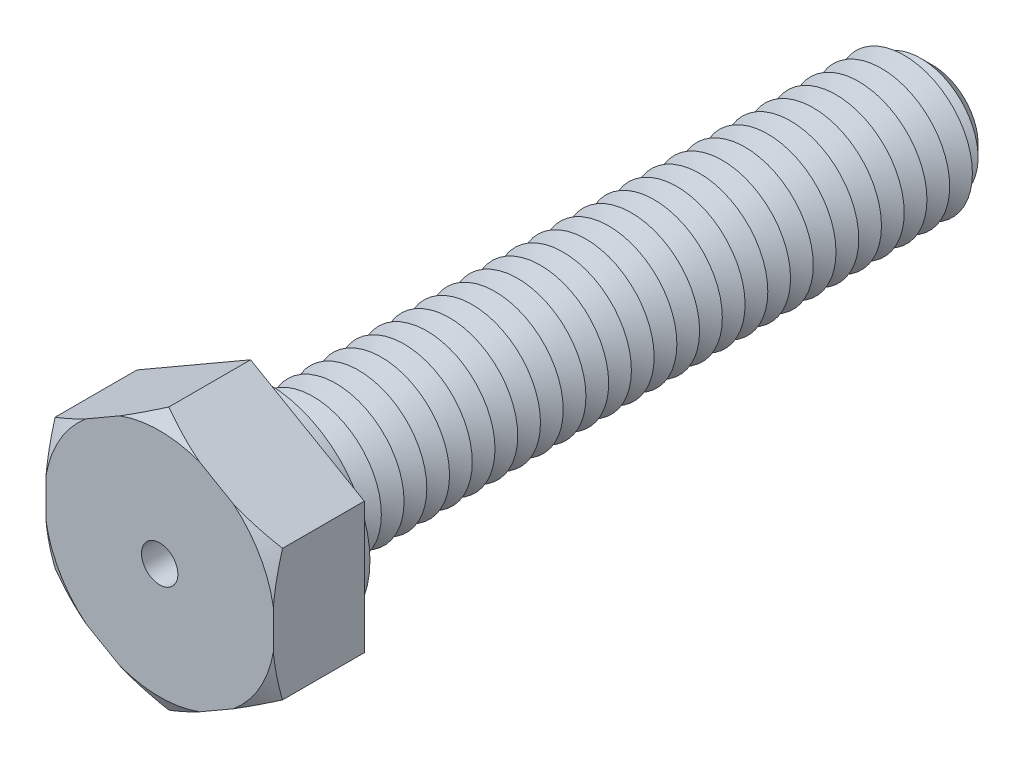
ISO-10303-21;
HEADER;
FILE_DESCRIPTION(('STEP AP214'),'2;1');
FILE_NAME('part.step','',(''),(''),'','','');
FILE_SCHEMA(('AUTOMOTIVE_DESIGN { 1 0 10303 214 1 1 1 1 }'));
ENDSEC;
DATA;
#1=APPLICATION_CONTEXT('core data for automotive mechanical design processes');
#2=APPLICATION_PROTOCOL_DEFINITION('international standard','automotive_design',2000,#1);
#3=PRODUCT_CONTEXT('',#1,'mechanical');
#4=PRODUCT('Part','Part','',(#3));
#5=PRODUCT_RELATED_PRODUCT_CATEGORY('part','',(#4));
#6=PRODUCT_DEFINITION_FORMATION('','',#4);
#7=PRODUCT_DEFINITION_CONTEXT('part definition',#1,'design');
#8=PRODUCT_DEFINITION('design','',#6,#7);
#9=PRODUCT_DEFINITION_SHAPE('','',#8);
#10=(LENGTH_UNIT() NAMED_UNIT(*) SI_UNIT(.MILLI.,.METRE.));
#11=(NAMED_UNIT(*) PLANE_ANGLE_UNIT() SI_UNIT($,.RADIAN.));
#12=(NAMED_UNIT(*) SI_UNIT($,.STERADIAN.) SOLID_ANGLE_UNIT());
#13=UNCERTAINTY_MEASURE_WITH_UNIT(LENGTH_MEASURE(1.E-05),#10,'distance_accuracy_value','');
#14=(GEOMETRIC_REPRESENTATION_CONTEXT(3) GLOBAL_UNCERTAINTY_ASSIGNED_CONTEXT((#13)) GLOBAL_UNIT_ASSIGNED_CONTEXT((#10,
#11,#12)) REPRESENTATION_CONTEXT('',''));
#15=CARTESIAN_POINT('',(0.,0.,0.));
#16=DIRECTION('',(0.,0.,1.));
#17=DIRECTION('',(1.,0.,0.));
#18=AXIS2_PLACEMENT_3D('',#15,#16,#17);
#19=CARTESIAN_POINT('',(5.,2.88675134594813,4.));
#20=DIRECTION('',(-0.5,-0.866025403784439,0.));
#21=DIRECTION('',(0.866025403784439,-0.5,0.));
#22=AXIS2_PLACEMENT_3D('',#19,#20,#21);
#23=PLANE('',#22);
#24=CARTESIAN_POINT('',(8.47277829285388,0.881741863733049,2.01100959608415));
#25=CARTESIAN_POINT('',(8.31567675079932,0.972444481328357,2.09578624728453));
#26=CARTESIAN_POINT('',(8.15819937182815,1.06336408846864,2.17964850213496));
#27=CARTESIAN_POINT('',(7.84233445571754,1.24572878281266,2.34511482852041));
#28=CARTESIAN_POINT('',(7.68394680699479,1.33717393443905,2.42671861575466));
#29=CARTESIAN_POINT('',(7.3656324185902,1.52095283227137,2.58747458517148));
#30=CARTESIAN_POINT('',(7.2057023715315,1.61328848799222,2.66661806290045));
#31=CARTESIAN_POINT('',(6.88464436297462,1.79865141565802,2.82158887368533));
#32=CARTESIAN_POINT('',(6.72351643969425,1.89167866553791,2.89741631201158));
#33=CARTESIAN_POINT('',(6.39574451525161,2.08091787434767,3.04691088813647));
#34=CARTESIAN_POINT('',(6.22906463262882,2.17715054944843,3.12047362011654));
#35=CARTESIAN_POINT('',(5.89404164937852,2.3705761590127,3.26235309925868));
#36=CARTESIAN_POINT('',(5.72569864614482,2.46776903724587,3.33067015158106));
#37=CARTESIAN_POINT('',(5.38728347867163,2.66315312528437,3.46077059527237));
#38=CARTESIAN_POINT('',(5.21721304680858,2.7613433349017,3.52255993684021));
#39=CARTESIAN_POINT('',(4.87507545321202,2.95887656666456,3.63817490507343));
#40=CARTESIAN_POINT('',(4.70300855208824,3.058219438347,3.69200155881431));
#41=CARTESIAN_POINT('',(4.29152467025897,3.29578976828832,3.8084273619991));
#42=CARTESIAN_POINT('',(4.05114917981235,3.43457062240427,3.86669526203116));
#43=CARTESIAN_POINT('',(3.68812002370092,3.64416560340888,3.93673911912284));
#44=CARTESIAN_POINT('',(3.56670137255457,3.71426669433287,3.95719387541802));
#45=CARTESIAN_POINT('',(3.32319777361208,3.85485356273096,3.99180309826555));
#46=CARTESIAN_POINT('',(3.20111291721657,3.92533928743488,4.0059584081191));
#47=CARTESIAN_POINT('',(2.95790980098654,4.06575267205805,4.0274398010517));
#48=CARTESIAN_POINT('',(2.83679666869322,4.13567737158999,4.03484289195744));
#49=CARTESIAN_POINT('',(2.59440145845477,4.27562431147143,4.04287861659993));
#50=CARTESIAN_POINT('',(2.47311938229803,4.34564655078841,4.0435113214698));
#51=CARTESIAN_POINT('',(2.23067249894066,4.48562332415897,4.03798617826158));
#52=CARTESIAN_POINT('',(2.10950769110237,4.55557785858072,4.03182836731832));
#53=CARTESIAN_POINT('',(1.86755304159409,4.695270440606,4.01290860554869));
#54=CARTESIAN_POINT('',(1.7467632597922,4.76500845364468,4.00014564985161));
#55=CARTESIAN_POINT('',(1.46148107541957,4.92971619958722,3.96252552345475));
#56=CARTESIAN_POINT('',(1.29725580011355,5.02453170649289,3.93494657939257));
#57=CARTESIAN_POINT('',(0.970375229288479,5.21325629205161,3.86938275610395));
#58=CARTESIAN_POINT('',(0.807720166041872,5.30716523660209,3.83139636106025));
#59=CARTESIAN_POINT('',(0.484000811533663,5.4940646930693,3.7464515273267));
#60=CARTESIAN_POINT('',(0.32293853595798,5.58705404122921,3.6994829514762));
#61=CARTESIAN_POINT('',(0.00262118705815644,5.77198934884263,3.59805355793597));
#62=CARTESIAN_POINT('',(-0.156634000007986,5.86393537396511,3.54359321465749));
#63=CARTESIAN_POINT('',(-0.475335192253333,6.04793759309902,3.42778810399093));
#64=CARTESIAN_POINT('',(-0.63476076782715,6.13998199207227,3.36636889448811));
#65=CARTESIAN_POINT('',(-0.951922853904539,6.3230956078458,3.2383676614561));
#66=CARTESIAN_POINT('',(-1.10966040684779,6.4141654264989,3.17178906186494));
#67=CARTESIAN_POINT('',(-1.42369760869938,6.59547488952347,3.03438397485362));
#68=CARTESIAN_POINT('',(-1.57999755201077,6.68571470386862,2.96355838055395));
#69=CARTESIAN_POINT('',(-1.89137153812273,6.86548655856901,2.81840247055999));
#70=CARTESIAN_POINT('',(-2.04644555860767,6.95501858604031,2.74407209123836));
#71=CARTESIAN_POINT('',(-2.30843737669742,7.1062796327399,2.61560341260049));
#72=CARTESIAN_POINT('',(-2.41563149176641,7.16816818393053,2.5622132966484));
#73=CARTESIAN_POINT('',(-2.62954890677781,7.29167346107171,2.45420118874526));
#74=CARTESIAN_POINT('',(-2.73627222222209,7.35329019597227,2.39957923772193));
#75=CARTESIAN_POINT('',(-2.94817046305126,7.4756297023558,2.28983212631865));
#76=CARTESIAN_POINT('',(-3.05334983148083,7.53635503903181,2.23471838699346));
#77=CARTESIAN_POINT('',(-3.26333506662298,7.65759007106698,2.12354428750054));
#78=CARTESIAN_POINT('',(-3.36814092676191,7.71809976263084,2.06748391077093));
#79=CARTESIAN_POINT('',(-3.47277829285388,7.77851217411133,2.01100959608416));
#80=B_SPLINE_CURVE_WITH_KNOTS('',3,(#24,#25,#26,#27,#28,#29,#30,#31,#32,#33,#34,#35,#36,#37,#38,
#39,#40,#41,#42,#43,#44,#45,#46,#47,#48,#49,#50,#51,#52,#53,#54,#55,#56,#57,#58,#59,#60,#61,#62,
#63,#64,#65,#66,#67,#68,#69,#70,#71,#72,#73,#74,#75,#76,#77,#78,#79),.UNSPECIFIED.,.F.,.F.,(4,2,
2,2,2,2,2,2,2,2,2,2,2,2,2,2,2,2,2,2,2,2,2,2,2,2,2,4),(0.,0.600718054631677,1.20151138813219,
1.80423204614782,2.40693355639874,3.02500509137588,3.64304064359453,4.26050788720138,
4.87789541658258,5.72780796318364,6.15275000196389,6.57763513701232,6.99761163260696,
7.41758371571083,7.83755350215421,8.25758719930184,8.83211758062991,9.40673168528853,
9.98199815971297,10.5572282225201,11.1393271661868,11.7210430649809,12.3026370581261,
12.8842416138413,13.2886376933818,13.6930203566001,14.0931288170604,14.493244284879),.UNSPECIFIED.);
#81=CARTESIAN_POINT('',(5.,2.88675134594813,3.59585481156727));
#82=VERTEX_POINT('',#81);
#83=CARTESIAN_POINT('',(3.24519941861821,3.89988593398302,4.));
#84=VERTEX_POINT('',#83);
#85=EDGE_CURVE('E132',#82,#84,#80,.T.);
#86=ORIENTED_EDGE('',*,*,#85,.F.);
#87=DIRECTION('',(0.,0.,-1.));
#88=VECTOR('',#87,1.);
#89=CARTESIAN_POINT('',(5.,2.88675134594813,4.));
#90=LINE('',#89,#88);
#91=CARTESIAN_POINT('',(5.,2.88675134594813,0.));
#92=VERTEX_POINT('',#91);
#93=EDGE_CURVE('E144',#82,#92,#90,.T.);
#94=ORIENTED_EDGE('',*,*,#93,.T.);
#95=DIRECTION('',(-0.866025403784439,0.5,0.));
#96=VECTOR('',#95,1.);
#97=CARTESIAN_POINT('',(5.,2.88675134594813,0.));
#98=LINE('',#97,#96);
#99=CARTESIAN_POINT('',(0.,5.77350269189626,0.));
#100=VERTEX_POINT('',#99);
#101=EDGE_CURVE('E435',#92,#100,#98,.T.);
#102=ORIENTED_EDGE('',*,*,#101,.T.);
#103=DIRECTION('',(0.,0.,-1.));
#104=VECTOR('',#103,1.);
#105=CARTESIAN_POINT('',(0.,5.77350269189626,4.));
#106=LINE('',#105,#104);
#107=CARTESIAN_POINT('',(0.,5.77350269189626,3.59585481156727));
#108=VERTEX_POINT('',#107);
#109=EDGE_CURVE('E179',#108,#100,#106,.T.);
#110=ORIENTED_EDGE('',*,*,#109,.F.);
#111=CARTESIAN_POINT('',(1.75480058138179,4.76036810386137,4.));
#112=VERTEX_POINT('',#111);
#113=EDGE_CURVE('E151',#112,#108,#80,.T.);
#114=ORIENTED_EDGE('',*,*,#113,.F.);
#115=DIRECTION('',(-0.866025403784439,0.5,0.));
#116=VECTOR('',#115,1.);
#117=CARTESIAN_POINT('',(5.,2.88675134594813,4.));
#118=LINE('',#117,#116);
#119=EDGE_CURVE('E148',#84,#112,#118,.T.);
#120=ORIENTED_EDGE('',*,*,#119,.F.);
#121=EDGE_LOOP('',(#86,#94,#102,#110,#114,#120));
#122=FACE_BOUND('',#121,.T.);
#123=ADVANCED_FACE('F39',(#122),#23,.F.);
#124=CARTESIAN_POINT('',(0.,5.77350269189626,4.));
#125=DIRECTION('',(0.5,-0.866025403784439,0.));
#126=DIRECTION('',(0.866025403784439,0.5,0.));
#127=AXIS2_PLACEMENT_3D('',#124,#125,#126);
#128=PLANE('',#127);
#129=CARTESIAN_POINT('',(3.47277829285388,7.77851217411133,2.01100959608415));
#130=CARTESIAN_POINT('',(3.31567675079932,7.68780955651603,2.09578624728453));
#131=CARTESIAN_POINT('',(3.15819937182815,7.59688994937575,2.17964850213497));
#132=CARTESIAN_POINT('',(2.84233445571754,7.41452525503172,2.34511482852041));
#133=CARTESIAN_POINT('',(2.68394680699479,7.32308010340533,2.42671861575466));
#134=CARTESIAN_POINT('',(2.36563241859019,7.13930120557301,2.58747458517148));
#135=CARTESIAN_POINT('',(2.2057023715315,7.04696554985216,2.66661806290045));
#136=CARTESIAN_POINT('',(1.88464436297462,6.86160262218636,2.82158887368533));
#137=CARTESIAN_POINT('',(1.72351643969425,6.76857537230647,2.89741631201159));
#138=CARTESIAN_POINT('',(1.39574451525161,6.57933616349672,3.04691088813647));
#139=CARTESIAN_POINT('',(1.22906463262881,6.48310348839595,3.12047362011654));
#140=CARTESIAN_POINT('',(0.894041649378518,6.28967787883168,3.26235309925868));
#141=CARTESIAN_POINT('',(0.725698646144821,6.19248500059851,3.33067015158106));
#142=CARTESIAN_POINT('',(0.38728347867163,5.99710091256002,3.46077059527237));
#143=CARTESIAN_POINT('',(0.217213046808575,5.89891070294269,3.52255993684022));
#144=CARTESIAN_POINT('',(-0.124924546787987,5.70137747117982,3.63817490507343));
#145=CARTESIAN_POINT('',(-0.296991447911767,5.60203459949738,3.69200155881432));
#146=CARTESIAN_POINT('',(-0.708475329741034,5.36446426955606,3.8084273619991));
#147=CARTESIAN_POINT('',(-0.948850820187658,5.22568341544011,3.86669526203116));
#148=CARTESIAN_POINT('',(-1.31187997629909,5.0160884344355,3.93673911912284));
#149=CARTESIAN_POINT('',(-1.43329862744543,4.94598734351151,3.95719387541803));
#150=CARTESIAN_POINT('',(-1.67680222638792,4.80540047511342,3.99180309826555));
#151=CARTESIAN_POINT('',(-1.79888708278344,4.7349147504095,4.0059584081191));
#152=CARTESIAN_POINT('',(-2.04209019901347,4.59450136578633,4.0274398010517));
#153=CARTESIAN_POINT('',(-2.16320333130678,4.52457666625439,4.03484289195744));
#154=CARTESIAN_POINT('',(-2.40559854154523,4.38462972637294,4.04287861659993));
#155=CARTESIAN_POINT('',(-2.52688061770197,4.31460748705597,4.04351132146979));
#156=CARTESIAN_POINT('',(-2.76932750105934,4.17463071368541,4.03798617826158));
#157=CARTESIAN_POINT('',(-2.89049230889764,4.10467617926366,4.03182836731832));
#158=CARTESIAN_POINT('',(-3.13244695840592,3.96498359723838,4.01290860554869));
#159=CARTESIAN_POINT('',(-3.25323674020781,3.8952455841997,4.00014564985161));
#160=CARTESIAN_POINT('',(-3.53851892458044,3.73053783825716,3.96252552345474));
#161=CARTESIAN_POINT('',(-3.70274419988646,3.63572233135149,3.93494657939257));
#162=CARTESIAN_POINT('',(-4.02962477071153,3.44699774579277,3.86938275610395));
#163=CARTESIAN_POINT('',(-4.19227983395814,3.35308880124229,3.83139636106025));
#164=CARTESIAN_POINT('',(-4.51599918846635,3.16618934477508,3.7464515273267));
#165=CARTESIAN_POINT('',(-4.67706146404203,3.07319999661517,3.6994829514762));
#166=CARTESIAN_POINT('',(-4.99737881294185,2.88826468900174,3.59805355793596));
#167=CARTESIAN_POINT('',(-5.156634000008,2.79631866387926,3.54359321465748));
#168=CARTESIAN_POINT('',(-5.47533519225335,2.61231644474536,3.42778810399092));
#169=CARTESIAN_POINT('',(-5.63476076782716,2.5202720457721,3.3663688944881));
#170=CARTESIAN_POINT('',(-5.95192285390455,2.33715842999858,3.23836766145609));
#171=CARTESIAN_POINT('',(-6.10966040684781,2.24608861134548,3.17178906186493));
#172=CARTESIAN_POINT('',(-6.4236976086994,2.0647791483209,3.03438397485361));
#173=CARTESIAN_POINT('',(-6.57999755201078,1.97453933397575,2.96355838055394));
#174=CARTESIAN_POINT('',(-6.89137153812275,1.79476747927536,2.81840247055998));
#175=CARTESIAN_POINT('',(-7.04644555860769,1.70523545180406,2.74407209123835));
#176=CARTESIAN_POINT('',(-7.30843737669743,1.55397440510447,2.61560341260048));
#177=CARTESIAN_POINT('',(-7.41563149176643,1.49208585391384,2.56221329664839));
#178=CARTESIAN_POINT('',(-7.62954890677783,1.36858057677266,2.45420118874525));
#179=CARTESIAN_POINT('',(-7.7362722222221,1.30696384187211,2.39957923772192));
#180=CARTESIAN_POINT('',(-7.94817046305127,1.18462433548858,2.28983212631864));
#181=CARTESIAN_POINT('',(-8.05334983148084,1.12389899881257,2.23471838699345));
#182=CARTESIAN_POINT('',(-8.26333506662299,1.0026639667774,2.12354428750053));
#183=CARTESIAN_POINT('',(-8.36814092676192,0.94215427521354,2.06748391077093));
#184=CARTESIAN_POINT('',(-8.47277829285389,0.881741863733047,2.01100959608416));
#185=B_SPLINE_CURVE_WITH_KNOTS('',3,(#129,#130,#131,#132,#133,#134,#135,#136,#137,#138,#139,
#140,#141,#142,#143,#144,#145,#146,#147,#148,#149,#150,#151,#152,#153,#154,#155,#156,#157,#158,
#159,#160,#161,#162,#163,#164,#165,#166,#167,#168,#169,#170,#171,#172,#173,#174,#175,#176,#177,
#178,#179,#180,#181,#182,#183,#184),.UNSPECIFIED.,.F.,.F.,(4,2,2,2,2,2,2,2,2,2,2,2,2,2,2,2,2,2,
2,2,2,2,2,2,2,2,2,4),(0.,0.600718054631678,1.20151138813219,1.80423204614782,2.40693355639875,
3.02500509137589,3.64304064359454,4.26050788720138,4.87789541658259,5.72780796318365,
6.1527500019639,6.57763513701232,6.99761163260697,7.41758371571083,7.83755350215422,
8.25758719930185,8.83211758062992,9.40673168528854,9.98199815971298,10.5572282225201,
11.1393271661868,11.7210430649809,12.3026370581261,12.8842416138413,13.2886376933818,
13.6930203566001,14.0931288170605,14.493244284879),.UNSPECIFIED.);
#186=CARTESIAN_POINT('',(-1.75480058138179,4.76036810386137,4.));
#187=VERTEX_POINT('',#186);
#188=EDGE_CURVE('E474',#108,#187,#185,.T.);
#189=ORIENTED_EDGE('',*,*,#188,.F.);
#190=ORIENTED_EDGE('',*,*,#109,.T.);
#191=DIRECTION('',(-0.866025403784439,-0.5,0.));
#192=VECTOR('',#191,1.);
#193=CARTESIAN_POINT('',(0.,5.77350269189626,0.));
#194=LINE('',#193,#192);
#195=CARTESIAN_POINT('',(-5.,2.88675134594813,0.));
#196=VERTEX_POINT('',#195);
#197=EDGE_CURVE('E455',#100,#196,#194,.T.);
#198=ORIENTED_EDGE('',*,*,#197,.T.);
#199=DIRECTION('',(0.,0.,-1.));
#200=VECTOR('',#199,1.);
#201=CARTESIAN_POINT('',(-5.,2.88675134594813,4.));
#202=LINE('',#201,#200);
#203=CARTESIAN_POINT('',(-5.,2.88675134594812,3.59585481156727));
#204=VERTEX_POINT('',#203);
#205=EDGE_CURVE('E176',#204,#196,#202,.T.);
#206=ORIENTED_EDGE('',*,*,#205,.F.);
#207=CARTESIAN_POINT('',(-3.24519941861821,3.89988593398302,4.));
#208=VERTEX_POINT('',#207);
#209=EDGE_CURVE('E473',#208,#204,#185,.T.);
#210=ORIENTED_EDGE('',*,*,#209,.F.);
#211=DIRECTION('',(-0.866025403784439,-0.5,0.));
#212=VECTOR('',#211,1.);
#213=CARTESIAN_POINT('',(0.,5.77350269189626,4.));
#214=LINE('',#213,#212);
#215=EDGE_CURVE('E438',#187,#208,#214,.T.);
#216=ORIENTED_EDGE('',*,*,#215,.F.);
#217=EDGE_LOOP('',(#189,#190,#198,#206,#210,#216));
#218=FACE_BOUND('',#217,.T.);
#219=ADVANCED_FACE('F534',(#218),#128,.F.);
#220=CARTESIAN_POINT('',(-5.,2.88675134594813,4.));
#221=DIRECTION('',(1.,0.,0.));
#222=DIRECTION('',(0.,0.,-1.));
#223=AXIS2_PLACEMENT_3D('',#220,#221,#222);
#224=PLANE('',#223);
#225=CARTESIAN_POINT('',(-5.,6.35952963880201,2.25858442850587));
#226=CARTESIAN_POINT('',(-5.,6.17888675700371,2.34055079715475));
#227=CARTESIAN_POINT('',(-5.,5.99774985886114,2.42144915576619));
#228=CARTESIAN_POINT('',(-5.,5.63427640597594,2.58059164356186));
#229=CARTESIAN_POINT('',(-5.,5.45193964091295,2.65883529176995));
#230=CARTESIAN_POINT('',(-5.,5.08515575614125,2.81244019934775));
#231=CARTESIAN_POINT('',(-5.,4.90070300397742,2.8877880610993));
#232=CARTESIAN_POINT('',(-5.,4.53023851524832,3.0345384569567));
#233=CARTESIAN_POINT('',(-5.,4.34422685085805,3.10594117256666));
#234=CARTESIAN_POINT('',(-5.,3.9712497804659,3.24361472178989));
#235=CARTESIAN_POINT('',(-5.,3.78429235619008,3.30990707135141));
#236=CARTESIAN_POINT('',(-5.,3.40837814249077,3.43663614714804));
#237=CARTESIAN_POINT('',(-5.,3.21942124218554,3.49707254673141));
#238=CARTESIAN_POINT('',(-5.,2.83960832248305,3.61070280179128));
#239=CARTESIAN_POINT('',(-5.,2.64875526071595,3.66390646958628));
#240=CARTESIAN_POINT('',(-5.,2.26482213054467,3.76165698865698));
#241=CARTESIAN_POINT('',(-5.,2.07174215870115,3.80620421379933));
#242=CARTESIAN_POINT('',(-5.,1.7384332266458,3.87385543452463));
#243=CARTESIAN_POINT('',(-5.,1.59871159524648,3.89946008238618));
#244=CARTESIAN_POINT('',(-5.,1.31833206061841,3.94478995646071));
#245=CARTESIAN_POINT('',(-5.,1.17767431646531,3.96451615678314));
#246=CARTESIAN_POINT('',(-5.,0.895629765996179,3.99757345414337));
#247=CARTESIAN_POINT('',(-5.,0.754243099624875,4.01090573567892));
#248=CARTESIAN_POINT('',(-5.,0.470989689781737,4.03079351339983));
#249=CARTESIAN_POINT('',(-5.,0.329122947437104,4.03734902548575));
#250=CARTESIAN_POINT('',(-5.,0.0453101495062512,4.04347876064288));
#251=CARTESIAN_POINT('',(-5.,-0.0966358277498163,4.04305657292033));
#252=CARTESIAN_POINT('',(-5.,-0.380333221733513,4.03525341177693));
#253=CARTESIAN_POINT('',(-5.,-0.522084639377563,4.02787247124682));
#254=CARTESIAN_POINT('',(-5.,-0.805078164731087,4.00637695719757));
#255=CARTESIAN_POINT('',(-5.,-0.946320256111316,3.99226216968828));
#256=CARTESIAN_POINT('',(-5.,-1.22803871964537,3.95770663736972));
#257=CARTESIAN_POINT('',(-5.,-1.36851494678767,3.93726473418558));
#258=CARTESIAN_POINT('',(-5.,-1.92842653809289,3.84388033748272));
#259=CARTESIAN_POINT('',(-5.,-2.34409397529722,3.74768165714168));
#260=CARTESIAN_POINT('',(-5.,-2.95991397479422,3.57615402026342));
#261=CARTESIAN_POINT('',(-5.,-3.16417440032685,3.51433916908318));
#262=CARTESIAN_POINT('',(-5.,-3.57033913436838,3.3833457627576));
#263=CARTESIAN_POINT('',(-5.,-3.77224360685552,3.31416772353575));
#264=CARTESIAN_POINT('',(-5.,-4.17620397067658,3.16907432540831));
#265=CARTESIAN_POINT('',(-5.,-4.37823505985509,3.09309081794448));
#266=CARTESIAN_POINT('',(-5.,-4.78041106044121,2.93626257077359));
#267=CARTESIAN_POINT('',(-5.,-4.98055585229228,2.85541752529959));
#268=CARTESIAN_POINT('',(-5.,-5.37797431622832,2.69033488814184));
#269=CARTESIAN_POINT('',(-5.,-5.57525810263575,2.60612151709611));
#270=CARTESIAN_POINT('',(-5.,-5.96839598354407,2.43454627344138));
#271=CARTESIAN_POINT('',(-5.,-6.16425041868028,2.34718518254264));
#272=CARTESIAN_POINT('',(-5.,-6.35952963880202,2.25858442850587));
#273=B_SPLINE_CURVE_WITH_KNOTS('',3,(#225,#226,#227,#228,#229,#230,#231,#232,#233,#234,#235,
#236,#237,#238,#239,#240,#241,#242,#243,#244,#245,#246,#247,#248,#249,#250,#251,#252,#253,#254,
#255,#256,#257,#258,#259,#260,#261,#262,#263,#264,#265,#266,#267,#268,#269,#270,#271,#272),
.UNSPECIFIED.,.F.,.F.,(4,2,2,2,2,2,2,2,2,2,2,2,2,2,2,2,2,2,2,2,2,2,2,4),(0.,0.595116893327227,
1.19034103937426,1.78805021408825,2.3857318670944,2.98074146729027,3.57578423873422,
4.17001151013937,4.7642131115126,5.19024951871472,5.61621528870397,6.0421021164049,
6.46798794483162,6.89365471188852,7.3193194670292,7.74499774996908,8.17075401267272,
9.44769357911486,10.0878733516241,10.7280082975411,11.3754821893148,12.0229968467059,
12.6664852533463,13.3098149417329),.UNSPECIFIED.);
#274=CARTESIAN_POINT('',(-5.,0.86048216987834,4.));
#275=VERTEX_POINT('',#274);
#276=EDGE_CURVE('E475',#204,#275,#273,.T.);
#277=ORIENTED_EDGE('',*,*,#276,.F.);
#278=ORIENTED_EDGE('',*,*,#205,.T.);
#279=DIRECTION('',(0.,-1.,0.));
#280=VECTOR('',#279,1.);
#281=CARTESIAN_POINT('',(-5.,2.88675134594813,0.));
#282=LINE('',#281,#280);
#283=CARTESIAN_POINT('',(-5.,-2.88675134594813,0.));
#284=VERTEX_POINT('',#283);
#285=EDGE_CURVE('E458',#196,#284,#282,.T.);
#286=ORIENTED_EDGE('',*,*,#285,.T.);
#287=DIRECTION('',(0.,0.,-1.));
#288=VECTOR('',#287,1.);
#289=CARTESIAN_POINT('',(-5.,-2.88675134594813,4.));
#290=LINE('',#289,#288);
#291=CARTESIAN_POINT('',(-4.99999999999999,-2.88675134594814,3.59585481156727));
#292=VERTEX_POINT('',#291);
#293=EDGE_CURVE('E173',#292,#284,#290,.T.);
#294=ORIENTED_EDGE('',*,*,#293,.F.);
#295=CARTESIAN_POINT('',(-5.,-0.86048216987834,4.));
#296=VERTEX_POINT('',#295);
#297=EDGE_CURVE('E481',#296,#292,#273,.T.);
#298=ORIENTED_EDGE('',*,*,#297,.F.);
#299=DIRECTION('',(0.,-1.,0.));
#300=VECTOR('',#299,1.);
#301=CARTESIAN_POINT('',(-5.,2.88675134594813,4.));
#302=LINE('',#301,#300);
#303=EDGE_CURVE('E442',#275,#296,#302,.T.);
#304=ORIENTED_EDGE('',*,*,#303,.F.);
#305=EDGE_LOOP('',(#277,#278,#286,#294,#298,#304));
#306=FACE_BOUND('',#305,.T.);
#307=ADVANCED_FACE('F530',(#306),#224,.F.);
#308=CARTESIAN_POINT('',(-5.,-2.88675134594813,4.));
#309=DIRECTION('',(0.5,0.866025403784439,0.));
#310=DIRECTION('',(-0.866025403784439,0.5,0.));
#311=AXIS2_PLACEMENT_3D('',#308,#309,#310);
#312=PLANE('',#311);
#313=CARTESIAN_POINT('',(-8.47277829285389,-0.881741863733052,2.01100959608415));
#314=CARTESIAN_POINT('',(-8.31567675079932,-0.972444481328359,2.09578624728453));
#315=CARTESIAN_POINT('',(-8.15819937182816,-1.06336408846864,2.17964850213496));
#316=CARTESIAN_POINT('',(-7.84233445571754,-1.24572878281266,2.34511482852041));
#317=CARTESIAN_POINT('',(-7.68394680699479,-1.33717393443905,2.42671861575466));
#318=CARTESIAN_POINT('',(-7.3656324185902,-1.52095283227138,2.58747458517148));
#319=CARTESIAN_POINT('',(-7.2057023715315,-1.61328848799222,2.66661806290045));
#320=CARTESIAN_POINT('',(-6.88464436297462,-1.79865141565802,2.82158887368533));
#321=CARTESIAN_POINT('',(-6.72351643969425,-1.89167866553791,2.89741631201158));
#322=CARTESIAN_POINT('',(-6.39574451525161,-2.08091787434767,3.04691088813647));
#323=CARTESIAN_POINT('',(-6.22906463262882,-2.17715054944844,3.12047362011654));
#324=CARTESIAN_POINT('',(-5.89404164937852,-2.37057615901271,3.26235309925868));
#325=CARTESIAN_POINT('',(-5.72569864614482,-2.46776903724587,3.33067015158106));
#326=CARTESIAN_POINT('',(-5.38728347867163,-2.66315312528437,3.46077059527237));
#327=CARTESIAN_POINT('',(-5.21721304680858,-2.7613433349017,3.52255993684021));
#328=CARTESIAN_POINT('',(-4.87507545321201,-2.95887656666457,3.63817490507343));
#329=CARTESIAN_POINT('',(-4.70300855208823,-3.05821943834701,3.69200155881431));
#330=CARTESIAN_POINT('',(-4.29152467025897,-3.29578976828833,3.8084273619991));
#331=CARTESIAN_POINT('',(-4.05114917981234,-3.43457062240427,3.86669526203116));
#332=CARTESIAN_POINT('',(-3.68812002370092,-3.64416560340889,3.93673911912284));
#333=CARTESIAN_POINT('',(-3.56670137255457,-3.71426669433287,3.95719387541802));
#334=CARTESIAN_POINT('',(-3.32319777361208,-3.85485356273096,3.99180309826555));
#335=CARTESIAN_POINT('',(-3.20111291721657,-3.92533928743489,4.0059584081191));
#336=CARTESIAN_POINT('',(-2.95790980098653,-4.06575267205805,4.0274398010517));
#337=CARTESIAN_POINT('',(-2.83679666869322,-4.13567737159,4.03484289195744));
#338=CARTESIAN_POINT('',(-2.59440145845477,-4.27562431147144,4.04287861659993));
#339=CARTESIAN_POINT('',(-2.47311938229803,-4.34564655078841,4.04351132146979));
#340=CARTESIAN_POINT('',(-2.23067249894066,-4.48562332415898,4.03798617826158));
#341=CARTESIAN_POINT('',(-2.10950769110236,-4.55557785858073,4.03182836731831));
#342=CARTESIAN_POINT('',(-1.86755304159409,-4.69527044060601,4.01290860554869));
#343=CARTESIAN_POINT('',(-1.74676325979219,-4.76500845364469,4.00014564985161));
#344=CARTESIAN_POINT('',(-1.46148107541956,-4.92971619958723,3.96252552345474));
#345=CARTESIAN_POINT('',(-1.29725580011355,-5.0245317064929,3.93494657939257));
#346=CARTESIAN_POINT('',(-0.970375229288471,-5.21325629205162,3.86938275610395));
#347=CARTESIAN_POINT('',(-0.807720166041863,-5.3071652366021,3.83139636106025));
#348=CARTESIAN_POINT('',(-0.484000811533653,-5.49406469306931,3.7464515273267));
#349=CARTESIAN_POINT('',(-0.322938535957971,-5.58705404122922,3.6994829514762));
#350=CARTESIAN_POINT('',(-0.00262118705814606,-5.77198934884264,3.59805355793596));
#351=CARTESIAN_POINT('',(0.156634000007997,-5.86393537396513,3.54359321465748));
#352=CARTESIAN_POINT('',(0.475335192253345,-6.04793759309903,3.42778810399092));
#353=CARTESIAN_POINT('',(0.634760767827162,-6.13998199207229,3.3663688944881));
#354=CARTESIAN_POINT('',(0.951922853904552,-6.32309560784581,3.23836766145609));
#355=CARTESIAN_POINT('',(1.10966040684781,-6.41416542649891,3.17178906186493));
#356=CARTESIAN_POINT('',(1.4236976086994,-6.59547488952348,3.03438397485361));
#357=CARTESIAN_POINT('',(1.57999755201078,-6.68571470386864,2.96355838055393));
#358=CARTESIAN_POINT('',(1.89137153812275,-6.86548655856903,2.81840247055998));
#359=CARTESIAN_POINT('',(2.04644555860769,-6.95501858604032,2.74407209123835));
#360=CARTESIAN_POINT('',(2.30843737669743,-7.10627963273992,2.61560341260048));
#361=CARTESIAN_POINT('',(2.41563149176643,-7.16816818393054,2.56221329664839));
#362=CARTESIAN_POINT('',(2.62954890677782,-7.29167346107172,2.45420118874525));
#363=CARTESIAN_POINT('',(2.73627222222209,-7.35329019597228,2.39957923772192));
#364=CARTESIAN_POINT('',(2.94817046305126,-7.47562970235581,2.28983212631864));
#365=CARTESIAN_POINT('',(3.05334983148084,-7.53635503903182,2.23471838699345));
#366=CARTESIAN_POINT('',(3.26333506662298,-7.65759007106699,2.12354428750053));
#367=CARTESIAN_POINT('',(3.36814092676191,-7.71809976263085,2.06748391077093));
#368=CARTESIAN_POINT('',(3.47277829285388,-7.77851217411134,2.01100959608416));
#369=B_SPLINE_CURVE_WITH_KNOTS('',3,(#313,#314,#315,#316,#317,#318,#319,#320,#321,#322,#323,
#324,#325,#326,#327,#328,#329,#330,#331,#332,#333,#334,#335,#336,#337,#338,#339,#340,#341,#342,
#343,#344,#345,#346,#347,#348,#349,#350,#351,#352,#353,#354,#355,#356,#357,#358,#359,#360,#361,
#362,#363,#364,#365,#366,#367,#368),.UNSPECIFIED.,.F.,.F.,(4,2,2,2,2,2,2,2,2,2,2,2,2,2,2,2,2,2,
2,2,2,2,2,2,2,2,2,4),(0.,0.600718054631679,1.20151138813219,1.80423204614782,2.40693355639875,
3.02500509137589,3.64304064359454,4.26050788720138,4.87789541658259,5.72780796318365,
6.1527500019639,6.57763513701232,6.99761163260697,7.41758371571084,7.83755350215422,
8.25758719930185,8.83211758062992,9.40673168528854,9.98199815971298,10.5572282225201,
11.1393271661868,11.7210430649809,12.3026370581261,12.8842416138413,13.2886376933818,
13.6930203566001,14.0931288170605,14.493244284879),.UNSPECIFIED.);
#370=CARTESIAN_POINT('',(-3.24519941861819,-3.89988593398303,4.));
#371=VERTEX_POINT('',#370);
#372=EDGE_CURVE('E480',#292,#371,#369,.T.);
#373=ORIENTED_EDGE('',*,*,#372,.F.);
#374=ORIENTED_EDGE('',*,*,#293,.T.);
#375=DIRECTION('',(0.866025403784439,-0.5,0.));
#376=VECTOR('',#375,1.);
#377=CARTESIAN_POINT('',(-5.,-2.88675134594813,0.));
#378=LINE('',#377,#376);
#379=CARTESIAN_POINT('',(0.,-5.77350269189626,0.));
#380=VERTEX_POINT('',#379);
#381=EDGE_CURVE('E462',#284,#380,#378,.T.);
#382=ORIENTED_EDGE('',*,*,#381,.T.);
#383=DIRECTION('',(0.,0.,-1.));
#384=VECTOR('',#383,1.);
#385=CARTESIAN_POINT('',(0.,-5.77350269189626,4.));
#386=LINE('',#385,#384);
#387=CARTESIAN_POINT('',(0.,-5.77350269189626,3.59585481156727));
#388=VERTEX_POINT('',#387);
#389=EDGE_CURVE('E163',#388,#380,#386,.T.);
#390=ORIENTED_EDGE('',*,*,#389,.F.);
#391=CARTESIAN_POINT('',(-1.75480058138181,-4.76036810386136,4.));
#392=VERTEX_POINT('',#391);
#393=EDGE_CURVE('E482',#392,#388,#369,.T.);
#394=ORIENTED_EDGE('',*,*,#393,.F.);
#395=DIRECTION('',(0.866025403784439,-0.5,0.));
#396=VECTOR('',#395,1.);
#397=CARTESIAN_POINT('',(-5.,-2.88675134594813,4.));
#398=LINE('',#397,#396);
#399=EDGE_CURVE('E446',#371,#392,#398,.T.);
#400=ORIENTED_EDGE('',*,*,#399,.F.);
#401=EDGE_LOOP('',(#373,#374,#382,#390,#394,#400));
#402=FACE_BOUND('',#401,.T.);
#403=ADVANCED_FACE('F533',(#402),#312,.F.);
#404=CARTESIAN_POINT('',(0.,-5.77350269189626,4.));
#405=DIRECTION('',(-0.5,0.866025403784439,0.));
#406=DIRECTION('',(-0.866025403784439,-0.5,0.));
#407=AXIS2_PLACEMENT_3D('',#404,#405,#406);
#408=PLANE('',#407);
#409=CARTESIAN_POINT('',(-3.47277829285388,-7.77851217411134,2.01100959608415));
#410=CARTESIAN_POINT('',(-3.31567675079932,-7.68780955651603,2.09578624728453));
#411=CARTESIAN_POINT('',(-3.15819937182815,-7.59688994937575,2.17964850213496));
#412=CARTESIAN_POINT('',(-2.84233445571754,-7.41452525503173,2.34511482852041));
#413=CARTESIAN_POINT('',(-2.68394680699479,-7.32308010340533,2.42671861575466));
#414=CARTESIAN_POINT('',(-2.36563241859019,-7.13930120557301,2.58747458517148));
#415=CARTESIAN_POINT('',(-2.2057023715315,-7.04696554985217,2.66661806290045));
#416=CARTESIAN_POINT('',(-1.88464436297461,-6.86160262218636,2.82158887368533));
#417=CARTESIAN_POINT('',(-1.72351643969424,-6.76857537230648,2.89741631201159));
#418=CARTESIAN_POINT('',(-1.39574451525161,-6.57933616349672,3.04691088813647));
#419=CARTESIAN_POINT('',(-1.22906463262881,-6.48310348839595,3.12047362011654));
#420=CARTESIAN_POINT('',(-0.894041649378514,-6.28967787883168,3.26235309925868));
#421=CARTESIAN_POINT('',(-0.725698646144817,-6.19248500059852,3.33067015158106));
#422=CARTESIAN_POINT('',(-0.387283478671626,-5.99710091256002,3.46077059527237));
#423=CARTESIAN_POINT('',(-0.217213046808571,-5.89891070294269,3.52255993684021));
#424=CARTESIAN_POINT('',(0.124924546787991,-5.70137747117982,3.63817490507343));
#425=CARTESIAN_POINT('',(0.296991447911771,-5.60203459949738,3.69200155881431));
#426=CARTESIAN_POINT('',(0.708475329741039,-5.36446426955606,3.8084273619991));
#427=CARTESIAN_POINT('',(0.948850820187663,-5.22568341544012,3.86669526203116));
#428=CARTESIAN_POINT('',(1.31187997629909,-5.0160884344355,3.93673911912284));
#429=CARTESIAN_POINT('',(1.43329862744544,-4.94598734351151,3.95719387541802));
#430=CARTESIAN_POINT('',(1.67680222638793,-4.80540047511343,3.99180309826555));
#431=CARTESIAN_POINT('',(1.79888708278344,-4.7349147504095,4.0059584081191));
#432=CARTESIAN_POINT('',(2.04209019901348,-4.59450136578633,4.0274398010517));
#433=CARTESIAN_POINT('',(2.16320333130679,-4.52457666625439,4.03484289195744));
#434=CARTESIAN_POINT('',(2.40559854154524,-4.38462972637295,4.04287861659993));
#435=CARTESIAN_POINT('',(2.52688061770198,-4.31460748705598,4.04351132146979));
#436=CARTESIAN_POINT('',(2.76932750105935,-4.17463071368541,4.03798617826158));
#437=CARTESIAN_POINT('',(2.89049230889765,-4.10467617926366,4.03182836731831));
#438=CARTESIAN_POINT('',(3.13244695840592,-3.96498359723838,4.01290860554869));
#439=CARTESIAN_POINT('',(3.25323674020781,-3.8952455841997,4.00014564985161));
#440=CARTESIAN_POINT('',(3.53851892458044,-3.73053783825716,3.96252552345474));
#441=CARTESIAN_POINT('',(3.70274419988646,-3.63572233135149,3.93494657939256));
#442=CARTESIAN_POINT('',(4.02962477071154,-3.44699774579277,3.86938275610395));
#443=CARTESIAN_POINT('',(4.19227983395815,-3.35308880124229,3.83139636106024));
#444=CARTESIAN_POINT('',(4.51599918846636,-3.16618934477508,3.7464515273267));
#445=CARTESIAN_POINT('',(4.67706146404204,-3.07319999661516,3.69948295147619));
#446=CARTESIAN_POINT('',(4.99737881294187,-2.88826468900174,3.59805355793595));
#447=CARTESIAN_POINT('',(5.15663400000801,-2.79631866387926,3.54359321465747));
#448=CARTESIAN_POINT('',(5.47533519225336,-2.61231644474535,3.42778810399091));
#449=CARTESIAN_POINT('',(5.63476076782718,-2.5202720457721,3.3663688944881));
#450=CARTESIAN_POINT('',(5.95192285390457,-2.33715842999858,3.23836766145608));
#451=CARTESIAN_POINT('',(6.10966040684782,-2.24608861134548,3.17178906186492));
#452=CARTESIAN_POINT('',(6.42369760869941,-2.0647791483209,3.0343839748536));
#453=CARTESIAN_POINT('',(6.5799975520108,-1.97453933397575,2.96355838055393));
#454=CARTESIAN_POINT('',(6.89137153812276,-1.79476747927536,2.81840247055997));
#455=CARTESIAN_POINT('',(7.04644555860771,-1.70523545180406,2.74407209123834));
#456=CARTESIAN_POINT('',(7.30843737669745,-1.55397440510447,2.61560341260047));
#457=CARTESIAN_POINT('',(7.41563149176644,-1.49208585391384,2.56221329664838));
#458=CARTESIAN_POINT('',(7.62954890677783,-1.36858057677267,2.45420118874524));
#459=CARTESIAN_POINT('',(7.7362722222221,-1.30696384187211,2.39957923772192));
#460=CARTESIAN_POINT('',(7.94817046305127,-1.18462433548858,2.28983212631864));
#461=CARTESIAN_POINT('',(8.05334983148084,-1.12389899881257,2.23471838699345));
#462=CARTESIAN_POINT('',(8.26333506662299,-1.00266396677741,2.12354428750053));
#463=CARTESIAN_POINT('',(8.36814092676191,-0.942154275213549,2.06748391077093));
#464=CARTESIAN_POINT('',(8.47277829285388,-0.881741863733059,2.01100959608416));
#465=B_SPLINE_CURVE_WITH_KNOTS('',3,(#409,#410,#411,#412,#413,#414,#415,#416,#417,#418,#419,
#420,#421,#422,#423,#424,#425,#426,#427,#428,#429,#430,#431,#432,#433,#434,#435,#436,#437,#438,
#439,#440,#441,#442,#443,#444,#445,#446,#447,#448,#449,#450,#451,#452,#453,#454,#455,#456,#457,
#458,#459,#460,#461,#462,#463,#464),.UNSPECIFIED.,.F.,.F.,(4,2,2,2,2,2,2,2,2,2,2,2,2,2,2,2,2,2,
2,2,2,2,2,2,2,2,2,4),(0.,0.600718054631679,1.20151138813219,1.80423204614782,2.40693355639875,
3.02500509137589,3.64304064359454,4.26050788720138,4.87789541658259,5.72780796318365,
6.1527500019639,6.57763513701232,6.99761163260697,7.41758371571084,7.83755350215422,
8.25758719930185,8.83211758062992,9.40673168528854,9.98199815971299,10.5572282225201,
11.1393271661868,11.7210430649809,12.3026370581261,12.8842416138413,13.2886376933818,
13.6930203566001,14.0931288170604,14.493244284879),.UNSPECIFIED.);
#466=CARTESIAN_POINT('',(1.75480058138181,-4.76036810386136,4.));
#467=VERTEX_POINT('',#466);
#468=EDGE_CURVE('E64',#388,#467,#465,.T.);
#469=ORIENTED_EDGE('',*,*,#468,.F.);
#470=ORIENTED_EDGE('',*,*,#389,.T.);
#471=DIRECTION('',(0.866025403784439,0.5,0.));
#472=VECTOR('',#471,1.);
#473=CARTESIAN_POINT('',(0.,-5.77350269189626,0.));
#474=LINE('',#473,#472);
#475=CARTESIAN_POINT('',(5.,-2.88675134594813,0.));
#476=VERTEX_POINT('',#475);
#477=EDGE_CURVE('E465',#380,#476,#474,.T.);
#478=ORIENTED_EDGE('',*,*,#477,.T.);
#479=DIRECTION('',(0.,0.,-1.));
#480=VECTOR('',#479,1.);
#481=CARTESIAN_POINT('',(5.,-2.88675134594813,4.));
#482=LINE('',#481,#480);
#483=CARTESIAN_POINT('',(5.,-2.88675134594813,3.59585481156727));
#484=VERTEX_POINT('',#483);
#485=EDGE_CURVE('E157',#484,#476,#482,.T.);
#486=ORIENTED_EDGE('',*,*,#485,.F.);
#487=CARTESIAN_POINT('',(3.24519941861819,-3.89988593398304,4.));
#488=VERTEX_POINT('',#487);
#489=EDGE_CURVE('E497',#488,#484,#465,.T.);
#490=ORIENTED_EDGE('',*,*,#489,.F.);
#491=DIRECTION('',(0.866025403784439,0.5,0.));
#492=VECTOR('',#491,1.);
#493=CARTESIAN_POINT('',(0.,-5.77350269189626,4.));
#494=LINE('',#493,#492);
#495=EDGE_CURVE('E166',#467,#488,#494,.T.);
#496=ORIENTED_EDGE('',*,*,#495,.F.);
#497=EDGE_LOOP('',(#469,#470,#478,#486,#490,#496));
#498=FACE_BOUND('',#497,.T.);
#499=ADVANCED_FACE('F573',(#498),#408,.F.);
#500=CARTESIAN_POINT('',(5.,-2.88675134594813,4.));
#501=DIRECTION('',(-1.,0.,0.));
#502=DIRECTION('',(0.,-1.,0.));
#503=AXIS2_PLACEMENT_3D('',#500,#501,#502);
#504=PLANE('',#503);
#505=CARTESIAN_POINT('',(5.,-6.35952963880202,2.25858442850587));
#506=CARTESIAN_POINT('',(5.,-6.17888675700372,2.34055079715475));
#507=CARTESIAN_POINT('',(5.,-5.99774985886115,2.42144915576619));
#508=CARTESIAN_POINT('',(5.,-5.63427640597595,2.58059164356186));
#509=CARTESIAN_POINT('',(5.,-5.45193964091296,2.65883529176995));
#510=CARTESIAN_POINT('',(5.,-5.08515575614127,2.81244019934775));
#511=CARTESIAN_POINT('',(5.,-4.90070300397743,2.8877880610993));
#512=CARTESIAN_POINT('',(5.,-4.53023851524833,3.0345384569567));
#513=CARTESIAN_POINT('',(5.,-4.34422685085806,3.10594117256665));
#514=CARTESIAN_POINT('',(5.,-3.97124978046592,3.24361472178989));
#515=CARTESIAN_POINT('',(5.,-3.78429235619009,3.3099070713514));
#516=CARTESIAN_POINT('',(5.,-3.40837814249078,3.43663614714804));
#517=CARTESIAN_POINT('',(5.,-3.21942124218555,3.4970725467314));
#518=CARTESIAN_POINT('',(5.,-2.83960832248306,3.61070280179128));
#519=CARTESIAN_POINT('',(5.,-2.64875526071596,3.66390646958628));
#520=CARTESIAN_POINT('',(5.,-2.26482213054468,3.76165698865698));
#521=CARTESIAN_POINT('',(5.,-2.07174215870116,3.80620421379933));
#522=CARTESIAN_POINT('',(5.,-1.7384332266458,3.87385543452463));
#523=CARTESIAN_POINT('',(5.,-1.59871159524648,3.89946008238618));
#524=CARTESIAN_POINT('',(5.,-1.31833206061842,3.94478995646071));
#525=CARTESIAN_POINT('',(5.,-1.17767431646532,3.96451615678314));
#526=CARTESIAN_POINT('',(5.,-0.895629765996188,3.99757345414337));
#527=CARTESIAN_POINT('',(5.,-0.754243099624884,4.01090573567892));
#528=CARTESIAN_POINT('',(5.,-0.470989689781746,4.03079351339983));
#529=CARTESIAN_POINT('',(5.,-0.329122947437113,4.03734902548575));
#530=CARTESIAN_POINT('',(5.,-0.0453101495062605,4.04347876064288));
#531=CARTESIAN_POINT('',(5.,0.0966358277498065,4.04305657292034));
#532=CARTESIAN_POINT('',(5.,0.380333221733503,4.03525341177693));
#533=CARTESIAN_POINT('',(5.,0.522084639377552,4.02787247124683));
#534=CARTESIAN_POINT('',(5.,0.805078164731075,4.00637695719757));
#535=CARTESIAN_POINT('',(5.,0.946320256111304,3.99226216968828));
#536=CARTESIAN_POINT('',(5.,1.22803871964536,3.95770663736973));
#537=CARTESIAN_POINT('',(5.,1.36851494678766,3.93726473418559));
#538=CARTESIAN_POINT('',(5.,1.92842653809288,3.84388033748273));
#539=CARTESIAN_POINT('',(5.,2.34409397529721,3.74768165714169));
#540=CARTESIAN_POINT('',(5.,2.95991397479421,3.57615402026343));
#541=CARTESIAN_POINT('',(5.,3.16417440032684,3.51433916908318));
#542=CARTESIAN_POINT('',(5.,3.57033913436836,3.3833457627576));
#543=CARTESIAN_POINT('',(5.,3.7722436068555,3.31416772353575));
#544=CARTESIAN_POINT('',(5.,4.17620397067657,3.16907432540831));
#545=CARTESIAN_POINT('',(5.,4.37823505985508,3.09309081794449));
#546=CARTESIAN_POINT('',(5.,4.7804110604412,2.9362625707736));
#547=CARTESIAN_POINT('',(5.,4.98055585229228,2.85541752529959));
#548=CARTESIAN_POINT('',(5.,5.37797431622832,2.69033488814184));
#549=CARTESIAN_POINT('',(5.,5.57525810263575,2.60612151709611));
#550=CARTESIAN_POINT('',(5.,5.96839598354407,2.43454627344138));
#551=CARTESIAN_POINT('',(5.,6.16425041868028,2.34718518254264));
#552=CARTESIAN_POINT('',(5.,6.35952963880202,2.25858442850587));
#553=B_SPLINE_CURVE_WITH_KNOTS('',3,(#505,#506,#507,#508,#509,#510,#511,#512,#513,#514,#515,
#516,#517,#518,#519,#520,#521,#522,#523,#524,#525,#526,#527,#528,#529,#530,#531,#532,#533,#534,
#535,#536,#537,#538,#539,#540,#541,#542,#543,#544,#545,#546,#547,#548,#549,#550,#551,#552),
.UNSPECIFIED.,.F.,.F.,(4,2,2,2,2,2,2,2,2,2,2,2,2,2,2,2,2,2,2,2,2,2,2,4),(0.,0.595116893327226,
1.19034103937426,1.78805021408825,2.3857318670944,2.98074146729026,3.57578423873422,
4.17001151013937,4.76421311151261,5.19024951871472,5.61621528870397,6.0421021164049,
6.46798794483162,6.89365471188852,7.3193194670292,7.74499774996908,8.17075401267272,
9.44769357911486,10.0878733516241,10.7280082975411,11.3754821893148,12.0229968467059,
12.6664852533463,13.3098149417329),.UNSPECIFIED.);
#554=CARTESIAN_POINT('',(5.,-0.860482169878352,4.));
#555=VERTEX_POINT('',#554);
#556=EDGE_CURVE('E56',#484,#555,#553,.T.);
#557=ORIENTED_EDGE('',*,*,#556,.F.);
#558=ORIENTED_EDGE('',*,*,#485,.T.);
#559=DIRECTION('',(0.,1.,0.));
#560=VECTOR('',#559,1.);
#561=CARTESIAN_POINT('',(5.,-2.88675134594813,0.));
#562=LINE('',#561,#560);
#563=EDGE_CURVE('E154',#476,#92,#562,.T.);
#564=ORIENTED_EDGE('',*,*,#563,.T.);
#565=ORIENTED_EDGE('',*,*,#93,.F.);
#566=CARTESIAN_POINT('',(5.,0.860482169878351,4.));
#567=VERTEX_POINT('',#566);
#568=EDGE_CURVE('E129',#567,#82,#553,.T.);
#569=ORIENTED_EDGE('',*,*,#568,.F.);
#570=DIRECTION('',(0.,1.,0.));
#571=VECTOR('',#570,1.);
#572=CARTESIAN_POINT('',(5.,-2.88675134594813,4.));
#573=LINE('',#572,#571);
#574=EDGE_CURVE('E158',#555,#567,#573,.T.);
#575=ORIENTED_EDGE('',*,*,#574,.F.);
#576=EDGE_LOOP('',(#557,#558,#564,#565,#569,#575));
#577=FACE_BOUND('',#576,.T.);
#578=ADVANCED_FACE('F152',(#577),#504,.F.);
#579=CARTESIAN_POINT('',(0.,0.,4.));
#580=DIRECTION('',(0.,0.,1.));
#581=DIRECTION('',(1.,0.,0.));
#582=AXIS2_PLACEMENT_3D('',#579,#580,#581);
#583=PLANE('',#582);
#584=CARTESIAN_POINT('',(0.,0.,4.));
#585=DIRECTION('',(0.,0.,1.));
#586=DIRECTION('',(1.,0.,0.));
#587=AXIS2_PLACEMENT_3D('',#584,#585,#586);
#588=CIRCLE('',#587,0.8);
#589=CARTESIAN_POINT('',(0.8,0.,4.));
#590=VERTEX_POINT('',#589);
#591=EDGE_CURVE('E559',#590,#590,#588,.T.);
#592=ORIENTED_EDGE('',*,*,#591,.F.);
#593=EDGE_LOOP('',(#592));
#594=FACE_BOUND('',#593,.T.);
#595=ORIENTED_EDGE('',*,*,#574,.T.);
#596=CARTESIAN_POINT('',(0.,0.,4.));
#597=DIRECTION('',(0.,0.,1.));
#598=DIRECTION('',(1.,0.,0.));
#599=AXIS2_PLACEMENT_3D('',#596,#597,#598);
#600=CIRCLE('',#599,5.07350269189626);
#601=EDGE_CURVE('E134',#567,#84,#600,.T.);
#602=ORIENTED_EDGE('',*,*,#601,.T.);
#603=ORIENTED_EDGE('',*,*,#119,.T.);
#604=CARTESIAN_POINT('',(0.,0.,4.));
#605=DIRECTION('',(0.,0.,1.));
#606=DIRECTION('',(1.,0.,0.));
#607=AXIS2_PLACEMENT_3D('',#604,#605,#606);
#608=CIRCLE('',#607,5.07350269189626);
#609=EDGE_CURVE('E11',#112,#187,#608,.T.);
#610=ORIENTED_EDGE('',*,*,#609,.T.);
#611=ORIENTED_EDGE('',*,*,#215,.T.);
#612=EDGE_CURVE('E49',#208,#275,#608,.T.);
#613=ORIENTED_EDGE('',*,*,#612,.T.);
#614=ORIENTED_EDGE('',*,*,#303,.T.);
#615=EDGE_CURVE('E478',#296,#371,#608,.T.);
#616=ORIENTED_EDGE('',*,*,#615,.T.);
#617=ORIENTED_EDGE('',*,*,#399,.T.);
#618=EDGE_CURVE('E576',#392,#467,#608,.T.);
#619=ORIENTED_EDGE('',*,*,#618,.T.);
#620=ORIENTED_EDGE('',*,*,#495,.T.);
#621=EDGE_CURVE('E43',#488,#555,#608,.T.);
#622=ORIENTED_EDGE('',*,*,#621,.T.);
#623=EDGE_LOOP('',(#595,#602,#603,#610,#611,#613,#614,#616,#617,#619,#620,#622));
#624=FACE_BOUND('',#623,.T.);
#625=ADVANCED_FACE('F570',(#594,#624),#583,.T.);
#626=CARTESIAN_POINT('',(0.,0.,0.));
#627=DIRECTION('',(0.,0.,1.));
#628=DIRECTION('',(1.,0.,0.));
#629=AXIS2_PLACEMENT_3D('',#626,#627,#628);
#630=PLANE('',#629);
#631=CARTESIAN_POINT('',(0.,0.,0.));
#632=DIRECTION('',(0.,0.,1.));
#633=DIRECTION('',(1.,0.,0.));
#634=AXIS2_PLACEMENT_3D('',#631,#632,#633);
#635=CIRCLE('',#634,4.5);
#636=CARTESIAN_POINT('',(4.5,0.,0.));
#637=VERTEX_POINT('',#636);
#638=EDGE_CURVE('E182',#637,#637,#635,.F.);
#639=ORIENTED_EDGE('',*,*,#638,.F.);
#640=EDGE_LOOP('',(#639));
#641=FACE_BOUND('',#640,.T.);
#642=ORIENTED_EDGE('',*,*,#101,.F.);
#643=ORIENTED_EDGE('',*,*,#563,.F.);
#644=ORIENTED_EDGE('',*,*,#477,.F.);
#645=ORIENTED_EDGE('',*,*,#381,.F.);
#646=ORIENTED_EDGE('',*,*,#285,.F.);
#647=ORIENTED_EDGE('',*,*,#197,.F.);
#648=EDGE_LOOP('',(#642,#643,#644,#645,#646,#647));
#649=FACE_BOUND('',#648,.T.);
#650=ADVANCED_FACE('F548',(#641,#649),#630,.F.);
#651=CARTESIAN_POINT('',(0.,0.,-0.75));
#652=DIRECTION('',(0.,0.,1.));
#653=DIRECTION('',(1.,0.,0.));
#654=AXIS2_PLACEMENT_3D('',#651,#652,#653);
#655=CYLINDRICAL_SURFACE('',#654,4.5);
#656=CARTESIAN_POINT('',(0.,0.,-0.75));
#657=DIRECTION('',(0.,0.,-1.));
#658=DIRECTION('',(-1.,0.,0.));
#659=AXIS2_PLACEMENT_3D('',#656,#657,#658);
#660=CIRCLE('',#659,4.5);
#661=CARTESIAN_POINT('',(-4.5,0.,-0.75));
#662=VERTEX_POINT('',#661);
#663=EDGE_CURVE('E431',#662,#662,#660,.T.);
#664=ORIENTED_EDGE('',*,*,#663,.F.);
#665=EDGE_LOOP('',(#664));
#666=FACE_BOUND('',#665,.T.);
#667=ORIENTED_EDGE('',*,*,#638,.T.);
#668=EDGE_LOOP('',(#667));
#669=FACE_BOUND('',#668,.T.);
#670=ADVANCED_FACE('F627',(#666,#669),#655,.T.);
#671=CARTESIAN_POINT('',(0.,0.,-0.75));
#672=DIRECTION('',(0.,0.,-1.));
#673=DIRECTION('',(-1.,0.,0.));
#674=AXIS2_PLACEMENT_3D('',#671,#672,#673);
#675=PLANE('',#674);
#676=CARTESIAN_POINT('',(0.,0.,-0.750000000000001));
#677=DIRECTION('',(0.,0.,1.));
#678=DIRECTION('',(1.,0.,0.));
#679=AXIS2_PLACEMENT_3D('',#676,#677,#678);
#680=CIRCLE('',#679,3.);
#681=CARTESIAN_POINT('',(3.,0.,-0.750000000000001));
#682=VERTEX_POINT('',#681);
#683=EDGE_CURVE('E427',#682,#682,#680,.T.);
#684=ORIENTED_EDGE('',*,*,#683,.T.);
#685=EDGE_LOOP('',(#684));
#686=FACE_BOUND('',#685,.T.);
#687=ORIENTED_EDGE('',*,*,#663,.T.);
#688=EDGE_LOOP('',(#687));
#689=FACE_BOUND('',#688,.T.);
#690=ADVANCED_FACE('F1237',(#686,#689),#675,.T.);
#691=CARTESIAN_POINT('',(0.,0.,-0.750000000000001));
#692=DIRECTION('',(0.,0.,1.));
#693=DIRECTION('',(1.,0.,0.));
#694=AXIS2_PLACEMENT_3D('',#691,#692,#693);
#695=CONICAL_SURFACE('',#694,3.,1.0471975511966);
#696=CARTESIAN_POINT('',(0.,0.,-1.25));
#697=DIRECTION('',(0.,0.,1.));
#698=DIRECTION('',(1.,0.,0.));
#699=AXIS2_PLACEMENT_3D('',#696,#697,#698);
#700=CIRCLE('',#699,2.13397459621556);
#701=CARTESIAN_POINT('',(2.13397459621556,0.,-1.25));
#702=VERTEX_POINT('',#701);
#703=EDGE_CURVE('E423',#702,#702,#700,.T.);
#704=ORIENTED_EDGE('',*,*,#703,.T.);
#705=EDGE_LOOP('',(#704));
#706=FACE_BOUND('',#705,.T.);
#707=ORIENTED_EDGE('',*,*,#683,.F.);
#708=EDGE_LOOP('',(#707));
#709=FACE_BOUND('',#708,.T.);
#710=ADVANCED_FACE('F1227',(#706,#709),#695,.T.);
#711=CARTESIAN_POINT('',(0.,0.,-1.25));
#712=DIRECTION('',(0.,0.,-1.));
#713=DIRECTION('',(-1.,0.,0.));
#714=AXIS2_PLACEMENT_3D('',#711,#712,#713);
#715=CONICAL_SURFACE('',#714,2.13397459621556,1.0471975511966);
#716=CARTESIAN_POINT('',(0.,0.,-1.75));
#717=DIRECTION('',(0.,0.,1.));
#718=DIRECTION('',(1.,0.,0.));
#719=AXIS2_PLACEMENT_3D('',#716,#717,#718);
#720=CIRCLE('',#719,3.);
#721=CARTESIAN_POINT('',(3.,0.,-1.75));
#722=VERTEX_POINT('',#721);
#723=EDGE_CURVE('E419',#722,#722,#720,.T.);
#724=ORIENTED_EDGE('',*,*,#723,.T.);
#725=EDGE_LOOP('',(#724));
#726=FACE_BOUND('',#725,.T.);
#727=ORIENTED_EDGE('',*,*,#703,.F.);
#728=EDGE_LOOP('',(#727));
#729=FACE_BOUND('',#728,.T.);
#730=ADVANCED_FACE('F1218',(#726,#729),#715,.T.);
#731=CARTESIAN_POINT('',(0.,0.,-1.75));
#732=DIRECTION('',(0.,0.,1.));
#733=DIRECTION('',(1.,0.,0.));
#734=AXIS2_PLACEMENT_3D('',#731,#732,#733);
#735=CONICAL_SURFACE('',#734,3.,1.0471975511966);
#736=CARTESIAN_POINT('',(0.,0.,-2.25));
#737=DIRECTION('',(0.,0.,1.));
#738=DIRECTION('',(1.,0.,0.));
#739=AXIS2_PLACEMENT_3D('',#736,#737,#738);
#740=CIRCLE('',#739,2.13397459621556);
#741=CARTESIAN_POINT('',(2.13397459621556,0.,-2.25));
#742=VERTEX_POINT('',#741);
#743=EDGE_CURVE('E415',#742,#742,#740,.T.);
#744=ORIENTED_EDGE('',*,*,#743,.T.);
#745=EDGE_LOOP('',(#744));
#746=FACE_BOUND('',#745,.T.);
#747=ORIENTED_EDGE('',*,*,#723,.F.);
#748=EDGE_LOOP('',(#747));
#749=FACE_BOUND('',#748,.T.);
#750=ADVANCED_FACE('F1209',(#746,#749),#735,.T.);
#751=CARTESIAN_POINT('',(0.,0.,-2.25));
#752=DIRECTION('',(0.,0.,-1.));
#753=DIRECTION('',(-1.,0.,0.));
#754=AXIS2_PLACEMENT_3D('',#751,#752,#753);
#755=CONICAL_SURFACE('',#754,2.13397459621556,1.0471975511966);
#756=CARTESIAN_POINT('',(0.,0.,-2.75));
#757=DIRECTION('',(0.,0.,1.));
#758=DIRECTION('',(1.,0.,0.));
#759=AXIS2_PLACEMENT_3D('',#756,#757,#758);
#760=CIRCLE('',#759,3.);
#761=CARTESIAN_POINT('',(3.,0.,-2.75));
#762=VERTEX_POINT('',#761);
#763=EDGE_CURVE('E411',#762,#762,#760,.T.);
#764=ORIENTED_EDGE('',*,*,#763,.T.);
#765=EDGE_LOOP('',(#764));
#766=FACE_BOUND('',#765,.T.);
#767=ORIENTED_EDGE('',*,*,#743,.F.);
#768=EDGE_LOOP('',(#767));
#769=FACE_BOUND('',#768,.T.);
#770=ADVANCED_FACE('F1199',(#766,#769),#755,.T.);
#771=CARTESIAN_POINT('',(0.,0.,-2.75));
#772=DIRECTION('',(0.,0.,1.));
#773=DIRECTION('',(1.,0.,0.));
#774=AXIS2_PLACEMENT_3D('',#771,#772,#773);
#775=CONICAL_SURFACE('',#774,3.,1.0471975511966);
#776=CARTESIAN_POINT('',(0.,0.,-3.25));
#777=DIRECTION('',(0.,0.,1.));
#778=DIRECTION('',(1.,0.,0.));
#779=AXIS2_PLACEMENT_3D('',#776,#777,#778);
#780=CIRCLE('',#779,2.13397459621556);
#781=CARTESIAN_POINT('',(2.13397459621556,0.,-3.25));
#782=VERTEX_POINT('',#781);
#783=EDGE_CURVE('E407',#782,#782,#780,.T.);
#784=ORIENTED_EDGE('',*,*,#783,.T.);
#785=EDGE_LOOP('',(#784));
#786=FACE_BOUND('',#785,.T.);
#787=ORIENTED_EDGE('',*,*,#763,.F.);
#788=EDGE_LOOP('',(#787));
#789=FACE_BOUND('',#788,.T.);
#790=ADVANCED_FACE('F1189',(#786,#789),#775,.T.);
#791=CARTESIAN_POINT('',(0.,0.,-3.25));
#792=DIRECTION('',(0.,0.,-1.));
#793=DIRECTION('',(-1.,0.,0.));
#794=AXIS2_PLACEMENT_3D('',#791,#792,#793);
#795=CONICAL_SURFACE('',#794,2.13397459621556,1.0471975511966);
#796=CARTESIAN_POINT('',(0.,0.,-3.75));
#797=DIRECTION('',(0.,0.,1.));
#798=DIRECTION('',(1.,0.,0.));
#799=AXIS2_PLACEMENT_3D('',#796,#797,#798);
#800=CIRCLE('',#799,3.);
#801=CARTESIAN_POINT('',(3.,0.,-3.75));
#802=VERTEX_POINT('',#801);
#803=EDGE_CURVE('E403',#802,#802,#800,.T.);
#804=ORIENTED_EDGE('',*,*,#803,.T.);
#805=EDGE_LOOP('',(#804));
#806=FACE_BOUND('',#805,.T.);
#807=ORIENTED_EDGE('',*,*,#783,.F.);
#808=EDGE_LOOP('',(#807));
#809=FACE_BOUND('',#808,.T.);
#810=ADVANCED_FACE('F1179',(#806,#809),#795,.T.);
#811=CARTESIAN_POINT('',(0.,0.,-3.75));
#812=DIRECTION('',(0.,0.,1.));
#813=DIRECTION('',(1.,0.,0.));
#814=AXIS2_PLACEMENT_3D('',#811,#812,#813);
#815=CONICAL_SURFACE('',#814,3.,1.0471975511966);
#816=CARTESIAN_POINT('',(0.,0.,-4.25));
#817=DIRECTION('',(0.,0.,1.));
#818=DIRECTION('',(1.,0.,0.));
#819=AXIS2_PLACEMENT_3D('',#816,#817,#818);
#820=CIRCLE('',#819,2.13397459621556);
#821=CARTESIAN_POINT('',(2.13397459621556,0.,-4.25));
#822=VERTEX_POINT('',#821);
#823=EDGE_CURVE('E399',#822,#822,#820,.T.);
#824=ORIENTED_EDGE('',*,*,#823,.T.);
#825=EDGE_LOOP('',(#824));
#826=FACE_BOUND('',#825,.T.);
#827=ORIENTED_EDGE('',*,*,#803,.F.);
#828=EDGE_LOOP('',(#827));
#829=FACE_BOUND('',#828,.T.);
#830=ADVANCED_FACE('F1169',(#826,#829),#815,.T.);
#831=CARTESIAN_POINT('',(0.,0.,-4.25));
#832=DIRECTION('',(0.,0.,-1.));
#833=DIRECTION('',(-1.,0.,0.));
#834=AXIS2_PLACEMENT_3D('',#831,#832,#833);
#835=CONICAL_SURFACE('',#834,2.13397459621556,1.0471975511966);
#836=CARTESIAN_POINT('',(0.,0.,-4.75));
#837=DIRECTION('',(0.,0.,1.));
#838=DIRECTION('',(1.,0.,0.));
#839=AXIS2_PLACEMENT_3D('',#836,#837,#838);
#840=CIRCLE('',#839,3.);
#841=CARTESIAN_POINT('',(3.,0.,-4.75));
#842=VERTEX_POINT('',#841);
#843=EDGE_CURVE('E395',#842,#842,#840,.T.);
#844=ORIENTED_EDGE('',*,*,#843,.T.);
#845=EDGE_LOOP('',(#844));
#846=FACE_BOUND('',#845,.T.);
#847=ORIENTED_EDGE('',*,*,#823,.F.);
#848=EDGE_LOOP('',(#847));
#849=FACE_BOUND('',#848,.T.);
#850=ADVANCED_FACE('F1159',(#846,#849),#835,.T.);
#851=CARTESIAN_POINT('',(0.,0.,-4.75));
#852=DIRECTION('',(0.,0.,1.));
#853=DIRECTION('',(1.,0.,0.));
#854=AXIS2_PLACEMENT_3D('',#851,#852,#853);
#855=CONICAL_SURFACE('',#854,3.,1.0471975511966);
#856=CARTESIAN_POINT('',(0.,0.,-5.25));
#857=DIRECTION('',(0.,0.,1.));
#858=DIRECTION('',(1.,0.,0.));
#859=AXIS2_PLACEMENT_3D('',#856,#857,#858);
#860=CIRCLE('',#859,2.13397459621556);
#861=CARTESIAN_POINT('',(2.13397459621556,0.,-5.25));
#862=VERTEX_POINT('',#861);
#863=EDGE_CURVE('E391',#862,#862,#860,.T.);
#864=ORIENTED_EDGE('',*,*,#863,.T.);
#865=EDGE_LOOP('',(#864));
#866=FACE_BOUND('',#865,.T.);
#867=ORIENTED_EDGE('',*,*,#843,.F.);
#868=EDGE_LOOP('',(#867));
#869=FACE_BOUND('',#868,.T.);
#870=ADVANCED_FACE('F1149',(#866,#869),#855,.T.);
#871=CARTESIAN_POINT('',(0.,0.,-5.25));
#872=DIRECTION('',(0.,0.,-1.));
#873=DIRECTION('',(-1.,0.,0.));
#874=AXIS2_PLACEMENT_3D('',#871,#872,#873);
#875=CONICAL_SURFACE('',#874,2.13397459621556,1.0471975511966);
#876=CARTESIAN_POINT('',(0.,0.,-5.75));
#877=DIRECTION('',(0.,0.,1.));
#878=DIRECTION('',(1.,0.,0.));
#879=AXIS2_PLACEMENT_3D('',#876,#877,#878);
#880=CIRCLE('',#879,3.);
#881=CARTESIAN_POINT('',(3.,0.,-5.75));
#882=VERTEX_POINT('',#881);
#883=EDGE_CURVE('E387',#882,#882,#880,.T.);
#884=ORIENTED_EDGE('',*,*,#883,.T.);
#885=EDGE_LOOP('',(#884));
#886=FACE_BOUND('',#885,.T.);
#887=ORIENTED_EDGE('',*,*,#863,.F.);
#888=EDGE_LOOP('',(#887));
#889=FACE_BOUND('',#888,.T.);
#890=ADVANCED_FACE('F1139',(#886,#889),#875,.T.);
#891=CARTESIAN_POINT('',(0.,0.,-5.75));
#892=DIRECTION('',(0.,0.,1.));
#893=DIRECTION('',(1.,0.,0.));
#894=AXIS2_PLACEMENT_3D('',#891,#892,#893);
#895=CONICAL_SURFACE('',#894,3.,1.0471975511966);
#896=CARTESIAN_POINT('',(0.,0.,-6.25));
#897=DIRECTION('',(0.,0.,1.));
#898=DIRECTION('',(1.,0.,0.));
#899=AXIS2_PLACEMENT_3D('',#896,#897,#898);
#900=CIRCLE('',#899,2.13397459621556);
#901=CARTESIAN_POINT('',(2.13397459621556,0.,-6.25));
#902=VERTEX_POINT('',#901);
#903=EDGE_CURVE('E383',#902,#902,#900,.T.);
#904=ORIENTED_EDGE('',*,*,#903,.T.);
#905=EDGE_LOOP('',(#904));
#906=FACE_BOUND('',#905,.T.);
#907=ORIENTED_EDGE('',*,*,#883,.F.);
#908=EDGE_LOOP('',(#907));
#909=FACE_BOUND('',#908,.T.);
#910=ADVANCED_FACE('F1129',(#906,#909),#895,.T.);
#911=CARTESIAN_POINT('',(0.,0.,-6.25));
#912=DIRECTION('',(0.,0.,-1.));
#913=DIRECTION('',(-1.,0.,0.));
#914=AXIS2_PLACEMENT_3D('',#911,#912,#913);
#915=CONICAL_SURFACE('',#914,2.13397459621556,1.0471975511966);
#916=CARTESIAN_POINT('',(0.,0.,-6.75));
#917=DIRECTION('',(0.,0.,1.));
#918=DIRECTION('',(1.,0.,0.));
#919=AXIS2_PLACEMENT_3D('',#916,#917,#918);
#920=CIRCLE('',#919,3.);
#921=CARTESIAN_POINT('',(3.,0.,-6.75));
#922=VERTEX_POINT('',#921);
#923=EDGE_CURVE('E379',#922,#922,#920,.T.);
#924=ORIENTED_EDGE('',*,*,#923,.T.);
#925=EDGE_LOOP('',(#924));
#926=FACE_BOUND('',#925,.T.);
#927=ORIENTED_EDGE('',*,*,#903,.F.);
#928=EDGE_LOOP('',(#927));
#929=FACE_BOUND('',#928,.T.);
#930=ADVANCED_FACE('F1119',(#926,#929),#915,.T.);
#931=CARTESIAN_POINT('',(0.,0.,-6.75));
#932=DIRECTION('',(0.,0.,1.));
#933=DIRECTION('',(1.,0.,0.));
#934=AXIS2_PLACEMENT_3D('',#931,#932,#933);
#935=CONICAL_SURFACE('',#934,3.,1.0471975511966);
#936=CARTESIAN_POINT('',(0.,0.,-7.25));
#937=DIRECTION('',(0.,0.,1.));
#938=DIRECTION('',(1.,0.,0.));
#939=AXIS2_PLACEMENT_3D('',#936,#937,#938);
#940=CIRCLE('',#939,2.13397459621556);
#941=CARTESIAN_POINT('',(2.13397459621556,0.,-7.25));
#942=VERTEX_POINT('',#941);
#943=EDGE_CURVE('E375',#942,#942,#940,.T.);
#944=ORIENTED_EDGE('',*,*,#943,.T.);
#945=EDGE_LOOP('',(#944));
#946=FACE_BOUND('',#945,.T.);
#947=ORIENTED_EDGE('',*,*,#923,.F.);
#948=EDGE_LOOP('',(#947));
#949=FACE_BOUND('',#948,.T.);
#950=ADVANCED_FACE('F1109',(#946,#949),#935,.T.);
#951=CARTESIAN_POINT('',(0.,0.,-7.25));
#952=DIRECTION('',(0.,0.,-1.));
#953=DIRECTION('',(-1.,0.,0.));
#954=AXIS2_PLACEMENT_3D('',#951,#952,#953);
#955=CONICAL_SURFACE('',#954,2.13397459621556,1.0471975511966);
#956=CARTESIAN_POINT('',(0.,0.,-7.75));
#957=DIRECTION('',(0.,0.,1.));
#958=DIRECTION('',(1.,0.,0.));
#959=AXIS2_PLACEMENT_3D('',#956,#957,#958);
#960=CIRCLE('',#959,3.);
#961=CARTESIAN_POINT('',(3.,0.,-7.75));
#962=VERTEX_POINT('',#961);
#963=EDGE_CURVE('E371',#962,#962,#960,.T.);
#964=ORIENTED_EDGE('',*,*,#963,.T.);
#965=EDGE_LOOP('',(#964));
#966=FACE_BOUND('',#965,.T.);
#967=ORIENTED_EDGE('',*,*,#943,.F.);
#968=EDGE_LOOP('',(#967));
#969=FACE_BOUND('',#968,.T.);
#970=ADVANCED_FACE('F1099',(#966,#969),#955,.T.);
#971=CARTESIAN_POINT('',(0.,0.,-7.75));
#972=DIRECTION('',(0.,0.,1.));
#973=DIRECTION('',(1.,0.,0.));
#974=AXIS2_PLACEMENT_3D('',#971,#972,#973);
#975=CONICAL_SURFACE('',#974,3.,1.0471975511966);
#976=CARTESIAN_POINT('',(0.,0.,-8.25));
#977=DIRECTION('',(0.,0.,1.));
#978=DIRECTION('',(1.,0.,0.));
#979=AXIS2_PLACEMENT_3D('',#976,#977,#978);
#980=CIRCLE('',#979,2.13397459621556);
#981=CARTESIAN_POINT('',(2.13397459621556,0.,-8.25));
#982=VERTEX_POINT('',#981);
#983=EDGE_CURVE('E367',#982,#982,#980,.T.);
#984=ORIENTED_EDGE('',*,*,#983,.T.);
#985=EDGE_LOOP('',(#984));
#986=FACE_BOUND('',#985,.T.);
#987=ORIENTED_EDGE('',*,*,#963,.F.);
#988=EDGE_LOOP('',(#987));
#989=FACE_BOUND('',#988,.T.);
#990=ADVANCED_FACE('F1089',(#986,#989),#975,.T.);
#991=CARTESIAN_POINT('',(0.,0.,-8.25));
#992=DIRECTION('',(0.,0.,-1.));
#993=DIRECTION('',(-1.,0.,0.));
#994=AXIS2_PLACEMENT_3D('',#991,#992,#993);
#995=CONICAL_SURFACE('',#994,2.13397459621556,1.0471975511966);
#996=CARTESIAN_POINT('',(0.,0.,-8.75));
#997=DIRECTION('',(0.,0.,1.));
#998=DIRECTION('',(1.,0.,0.));
#999=AXIS2_PLACEMENT_3D('',#996,#997,#998);
#1000=CIRCLE('',#999,3.);
#1001=CARTESIAN_POINT('',(3.,0.,-8.75));
#1002=VERTEX_POINT('',#1001);
#1003=EDGE_CURVE('E363',#1002,#1002,#1000,.T.);
#1004=ORIENTED_EDGE('',*,*,#1003,.T.);
#1005=EDGE_LOOP('',(#1004));
#1006=FACE_BOUND('',#1005,.T.);
#1007=ORIENTED_EDGE('',*,*,#983,.F.);
#1008=EDGE_LOOP('',(#1007));
#1009=FACE_BOUND('',#1008,.T.);
#1010=ADVANCED_FACE('F1079',(#1006,#1009),#995,.T.);
#1011=CARTESIAN_POINT('',(0.,0.,-8.75));
#1012=DIRECTION('',(0.,0.,1.));
#1013=DIRECTION('',(1.,0.,0.));
#1014=AXIS2_PLACEMENT_3D('',#1011,#1012,#1013);
#1015=CONICAL_SURFACE('',#1014,3.,1.0471975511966);
#1016=CARTESIAN_POINT('',(0.,0.,-9.25));
#1017=DIRECTION('',(0.,0.,1.));
#1018=DIRECTION('',(1.,0.,0.));
#1019=AXIS2_PLACEMENT_3D('',#1016,#1017,#1018);
#1020=CIRCLE('',#1019,2.13397459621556);
#1021=CARTESIAN_POINT('',(2.13397459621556,0.,-9.25));
#1022=VERTEX_POINT('',#1021);
#1023=EDGE_CURVE('E359',#1022,#1022,#1020,.T.);
#1024=ORIENTED_EDGE('',*,*,#1023,.T.);
#1025=EDGE_LOOP('',(#1024));
#1026=FACE_BOUND('',#1025,.T.);
#1027=ORIENTED_EDGE('',*,*,#1003,.F.);
#1028=EDGE_LOOP('',(#1027));
#1029=FACE_BOUND('',#1028,.T.);
#1030=ADVANCED_FACE('F1069',(#1026,#1029),#1015,.T.);
#1031=CARTESIAN_POINT('',(0.,0.,-9.25));
#1032=DIRECTION('',(0.,0.,-1.));
#1033=DIRECTION('',(-1.,0.,0.));
#1034=AXIS2_PLACEMENT_3D('',#1031,#1032,#1033);
#1035=CONICAL_SURFACE('',#1034,2.13397459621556,1.0471975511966);
#1036=CARTESIAN_POINT('',(0.,0.,-9.75));
#1037=DIRECTION('',(0.,0.,1.));
#1038=DIRECTION('',(1.,0.,0.));
#1039=AXIS2_PLACEMENT_3D('',#1036,#1037,#1038);
#1040=CIRCLE('',#1039,3.);
#1041=CARTESIAN_POINT('',(3.,0.,-9.75));
#1042=VERTEX_POINT('',#1041);
#1043=EDGE_CURVE('E355',#1042,#1042,#1040,.T.);
#1044=ORIENTED_EDGE('',*,*,#1043,.T.);
#1045=EDGE_LOOP('',(#1044));
#1046=FACE_BOUND('',#1045,.T.);
#1047=ORIENTED_EDGE('',*,*,#1023,.F.);
#1048=EDGE_LOOP('',(#1047));
#1049=FACE_BOUND('',#1048,.T.);
#1050=ADVANCED_FACE('F1059',(#1046,#1049),#1035,.T.);
#1051=CARTESIAN_POINT('',(0.,0.,-9.75));
#1052=DIRECTION('',(0.,0.,1.));
#1053=DIRECTION('',(1.,0.,0.));
#1054=AXIS2_PLACEMENT_3D('',#1051,#1052,#1053);
#1055=CONICAL_SURFACE('',#1054,3.,1.0471975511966);
#1056=CARTESIAN_POINT('',(0.,0.,-10.25));
#1057=DIRECTION('',(0.,0.,1.));
#1058=DIRECTION('',(1.,0.,0.));
#1059=AXIS2_PLACEMENT_3D('',#1056,#1057,#1058);
#1060=CIRCLE('',#1059,2.13397459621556);
#1061=CARTESIAN_POINT('',(2.13397459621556,0.,-10.25));
#1062=VERTEX_POINT('',#1061);
#1063=EDGE_CURVE('E351',#1062,#1062,#1060,.T.);
#1064=ORIENTED_EDGE('',*,*,#1063,.T.);
#1065=EDGE_LOOP('',(#1064));
#1066=FACE_BOUND('',#1065,.T.);
#1067=ORIENTED_EDGE('',*,*,#1043,.F.);
#1068=EDGE_LOOP('',(#1067));
#1069=FACE_BOUND('',#1068,.T.);
#1070=ADVANCED_FACE('F1049',(#1066,#1069),#1055,.T.);
#1071=CARTESIAN_POINT('',(0.,0.,-10.25));
#1072=DIRECTION('',(0.,0.,-1.));
#1073=DIRECTION('',(-1.,0.,0.));
#1074=AXIS2_PLACEMENT_3D('',#1071,#1072,#1073);
#1075=CONICAL_SURFACE('',#1074,2.13397459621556,1.0471975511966);
#1076=CARTESIAN_POINT('',(0.,0.,-10.75));
#1077=DIRECTION('',(0.,0.,1.));
#1078=DIRECTION('',(1.,0.,0.));
#1079=AXIS2_PLACEMENT_3D('',#1076,#1077,#1078);
#1080=CIRCLE('',#1079,3.);
#1081=CARTESIAN_POINT('',(3.,0.,-10.75));
#1082=VERTEX_POINT('',#1081);
#1083=EDGE_CURVE('E348',#1082,#1082,#1080,.T.);
#1084=ORIENTED_EDGE('',*,*,#1083,.T.);
#1085=EDGE_LOOP('',(#1084));
#1086=FACE_BOUND('',#1085,.T.);
#1087=ORIENTED_EDGE('',*,*,#1063,.F.);
#1088=EDGE_LOOP('',(#1087));
#1089=FACE_BOUND('',#1088,.T.);
#1090=ADVANCED_FACE('F1039',(#1086,#1089),#1075,.T.);
#1091=CARTESIAN_POINT('',(0.,0.,-10.75));
#1092=DIRECTION('',(0.,0.,1.));
#1093=DIRECTION('',(1.,0.,0.));
#1094=AXIS2_PLACEMENT_3D('',#1091,#1092,#1093);
#1095=CONICAL_SURFACE('',#1094,3.,1.0471975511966);
#1096=CARTESIAN_POINT('',(0.,0.,-11.25));
#1097=DIRECTION('',(0.,0.,1.));
#1098=DIRECTION('',(1.,0.,0.));
#1099=AXIS2_PLACEMENT_3D('',#1096,#1097,#1098);
#1100=CIRCLE('',#1099,2.13397459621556);
#1101=CARTESIAN_POINT('',(2.13397459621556,0.,-11.25));
#1102=VERTEX_POINT('',#1101);
#1103=EDGE_CURVE('E344',#1102,#1102,#1100,.T.);
#1104=ORIENTED_EDGE('',*,*,#1103,.T.);
#1105=EDGE_LOOP('',(#1104));
#1106=FACE_BOUND('',#1105,.T.);
#1107=ORIENTED_EDGE('',*,*,#1083,.F.);
#1108=EDGE_LOOP('',(#1107));
#1109=FACE_BOUND('',#1108,.T.);
#1110=ADVANCED_FACE('F1029',(#1106,#1109),#1095,.T.);
#1111=CARTESIAN_POINT('',(0.,0.,-11.25));
#1112=DIRECTION('',(0.,0.,-1.));
#1113=DIRECTION('',(-1.,0.,0.));
#1114=AXIS2_PLACEMENT_3D('',#1111,#1112,#1113);
#1115=CONICAL_SURFACE('',#1114,2.13397459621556,1.0471975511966);
#1116=CARTESIAN_POINT('',(0.,0.,-11.75));
#1117=DIRECTION('',(0.,0.,1.));
#1118=DIRECTION('',(1.,0.,0.));
#1119=AXIS2_PLACEMENT_3D('',#1116,#1117,#1118);
#1120=CIRCLE('',#1119,3.);
#1121=CARTESIAN_POINT('',(3.,0.,-11.75));
#1122=VERTEX_POINT('',#1121);
#1123=EDGE_CURVE('E340',#1122,#1122,#1120,.T.);
#1124=ORIENTED_EDGE('',*,*,#1123,.T.);
#1125=EDGE_LOOP('',(#1124));
#1126=FACE_BOUND('',#1125,.T.);
#1127=ORIENTED_EDGE('',*,*,#1103,.F.);
#1128=EDGE_LOOP('',(#1127));
#1129=FACE_BOUND('',#1128,.T.);
#1130=ADVANCED_FACE('F1019',(#1126,#1129),#1115,.T.);
#1131=CARTESIAN_POINT('',(0.,0.,-11.75));
#1132=DIRECTION('',(0.,0.,1.));
#1133=DIRECTION('',(1.,0.,0.));
#1134=AXIS2_PLACEMENT_3D('',#1131,#1132,#1133);
#1135=CONICAL_SURFACE('',#1134,3.,1.0471975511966);
#1136=CARTESIAN_POINT('',(0.,0.,-12.25));
#1137=DIRECTION('',(0.,0.,1.));
#1138=DIRECTION('',(1.,0.,0.));
#1139=AXIS2_PLACEMENT_3D('',#1136,#1137,#1138);
#1140=CIRCLE('',#1139,2.13397459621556);
#1141=CARTESIAN_POINT('',(2.13397459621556,0.,-12.25));
#1142=VERTEX_POINT('',#1141);
#1143=EDGE_CURVE('E336',#1142,#1142,#1140,.T.);
#1144=ORIENTED_EDGE('',*,*,#1143,.T.);
#1145=EDGE_LOOP('',(#1144));
#1146=FACE_BOUND('',#1145,.T.);
#1147=ORIENTED_EDGE('',*,*,#1123,.F.);
#1148=EDGE_LOOP('',(#1147));
#1149=FACE_BOUND('',#1148,.T.);
#1150=ADVANCED_FACE('F1009',(#1146,#1149),#1135,.T.);
#1151=CARTESIAN_POINT('',(0.,0.,-12.25));
#1152=DIRECTION('',(0.,0.,-1.));
#1153=DIRECTION('',(-1.,0.,0.));
#1154=AXIS2_PLACEMENT_3D('',#1151,#1152,#1153);
#1155=CONICAL_SURFACE('',#1154,2.13397459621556,1.0471975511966);
#1156=CARTESIAN_POINT('',(0.,0.,-12.75));
#1157=DIRECTION('',(0.,0.,1.));
#1158=DIRECTION('',(1.,0.,0.));
#1159=AXIS2_PLACEMENT_3D('',#1156,#1157,#1158);
#1160=CIRCLE('',#1159,3.);
#1161=CARTESIAN_POINT('',(3.,0.,-12.75));
#1162=VERTEX_POINT('',#1161);
#1163=EDGE_CURVE('E332',#1162,#1162,#1160,.T.);
#1164=ORIENTED_EDGE('',*,*,#1163,.T.);
#1165=EDGE_LOOP('',(#1164));
#1166=FACE_BOUND('',#1165,.T.);
#1167=ORIENTED_EDGE('',*,*,#1143,.F.);
#1168=EDGE_LOOP('',(#1167));
#1169=FACE_BOUND('',#1168,.T.);
#1170=ADVANCED_FACE('F999',(#1166,#1169),#1155,.T.);
#1171=CARTESIAN_POINT('',(0.,0.,-12.75));
#1172=DIRECTION('',(0.,0.,1.));
#1173=DIRECTION('',(1.,0.,0.));
#1174=AXIS2_PLACEMENT_3D('',#1171,#1172,#1173);
#1175=CONICAL_SURFACE('',#1174,3.,1.0471975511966);
#1176=CARTESIAN_POINT('',(0.,0.,-13.25));
#1177=DIRECTION('',(0.,0.,1.));
#1178=DIRECTION('',(1.,0.,0.));
#1179=AXIS2_PLACEMENT_3D('',#1176,#1177,#1178);
#1180=CIRCLE('',#1179,2.13397459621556);
#1181=CARTESIAN_POINT('',(2.13397459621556,0.,-13.25));
#1182=VERTEX_POINT('',#1181);
#1183=EDGE_CURVE('E328',#1182,#1182,#1180,.T.);
#1184=ORIENTED_EDGE('',*,*,#1183,.T.);
#1185=EDGE_LOOP('',(#1184));
#1186=FACE_BOUND('',#1185,.T.);
#1187=ORIENTED_EDGE('',*,*,#1163,.F.);
#1188=EDGE_LOOP('',(#1187));
#1189=FACE_BOUND('',#1188,.T.);
#1190=ADVANCED_FACE('F989',(#1186,#1189),#1175,.T.);
#1191=CARTESIAN_POINT('',(0.,0.,-13.25));
#1192=DIRECTION('',(0.,0.,-1.));
#1193=DIRECTION('',(-1.,0.,0.));
#1194=AXIS2_PLACEMENT_3D('',#1191,#1192,#1193);
#1195=CONICAL_SURFACE('',#1194,2.13397459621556,1.0471975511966);
#1196=CARTESIAN_POINT('',(0.,0.,-13.75));
#1197=DIRECTION('',(0.,0.,1.));
#1198=DIRECTION('',(1.,0.,0.));
#1199=AXIS2_PLACEMENT_3D('',#1196,#1197,#1198);
#1200=CIRCLE('',#1199,3.);
#1201=CARTESIAN_POINT('',(3.,0.,-13.75));
#1202=VERTEX_POINT('',#1201);
#1203=EDGE_CURVE('E324',#1202,#1202,#1200,.T.);
#1204=ORIENTED_EDGE('',*,*,#1203,.T.);
#1205=EDGE_LOOP('',(#1204));
#1206=FACE_BOUND('',#1205,.T.);
#1207=ORIENTED_EDGE('',*,*,#1183,.F.);
#1208=EDGE_LOOP('',(#1207));
#1209=FACE_BOUND('',#1208,.T.);
#1210=ADVANCED_FACE('F979',(#1206,#1209),#1195,.T.);
#1211=CARTESIAN_POINT('',(0.,0.,-13.75));
#1212=DIRECTION('',(0.,0.,1.));
#1213=DIRECTION('',(1.,0.,0.));
#1214=AXIS2_PLACEMENT_3D('',#1211,#1212,#1213);
#1215=CONICAL_SURFACE('',#1214,3.,1.0471975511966);
#1216=CARTESIAN_POINT('',(0.,0.,-14.25));
#1217=DIRECTION('',(0.,0.,1.));
#1218=DIRECTION('',(1.,0.,0.));
#1219=AXIS2_PLACEMENT_3D('',#1216,#1217,#1218);
#1220=CIRCLE('',#1219,2.13397459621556);
#1221=CARTESIAN_POINT('',(2.13397459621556,0.,-14.25));
#1222=VERTEX_POINT('',#1221);
#1223=EDGE_CURVE('E320',#1222,#1222,#1220,.T.);
#1224=ORIENTED_EDGE('',*,*,#1223,.T.);
#1225=EDGE_LOOP('',(#1224));
#1226=FACE_BOUND('',#1225,.T.);
#1227=ORIENTED_EDGE('',*,*,#1203,.F.);
#1228=EDGE_LOOP('',(#1227));
#1229=FACE_BOUND('',#1228,.T.);
#1230=ADVANCED_FACE('F969',(#1226,#1229),#1215,.T.);
#1231=CARTESIAN_POINT('',(0.,0.,-14.25));
#1232=DIRECTION('',(0.,0.,-1.));
#1233=DIRECTION('',(-1.,0.,0.));
#1234=AXIS2_PLACEMENT_3D('',#1231,#1232,#1233);
#1235=CONICAL_SURFACE('',#1234,2.13397459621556,1.0471975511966);
#1236=CARTESIAN_POINT('',(0.,0.,-14.75));
#1237=DIRECTION('',(0.,0.,1.));
#1238=DIRECTION('',(1.,0.,0.));
#1239=AXIS2_PLACEMENT_3D('',#1236,#1237,#1238);
#1240=CIRCLE('',#1239,3.);
#1241=CARTESIAN_POINT('',(3.,0.,-14.75));
#1242=VERTEX_POINT('',#1241);
#1243=EDGE_CURVE('E316',#1242,#1242,#1240,.T.);
#1244=ORIENTED_EDGE('',*,*,#1243,.T.);
#1245=EDGE_LOOP('',(#1244));
#1246=FACE_BOUND('',#1245,.T.);
#1247=ORIENTED_EDGE('',*,*,#1223,.F.);
#1248=EDGE_LOOP('',(#1247));
#1249=FACE_BOUND('',#1248,.T.);
#1250=ADVANCED_FACE('F959',(#1246,#1249),#1235,.T.);
#1251=CARTESIAN_POINT('',(0.,0.,-14.75));
#1252=DIRECTION('',(0.,0.,1.));
#1253=DIRECTION('',(1.,0.,0.));
#1254=AXIS2_PLACEMENT_3D('',#1251,#1252,#1253);
#1255=CONICAL_SURFACE('',#1254,3.,1.0471975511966);
#1256=CARTESIAN_POINT('',(0.,0.,-15.25));
#1257=DIRECTION('',(0.,0.,1.));
#1258=DIRECTION('',(1.,0.,0.));
#1259=AXIS2_PLACEMENT_3D('',#1256,#1257,#1258);
#1260=CIRCLE('',#1259,2.13397459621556);
#1261=CARTESIAN_POINT('',(2.13397459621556,0.,-15.25));
#1262=VERTEX_POINT('',#1261);
#1263=EDGE_CURVE('E312',#1262,#1262,#1260,.T.);
#1264=ORIENTED_EDGE('',*,*,#1263,.T.);
#1265=EDGE_LOOP('',(#1264));
#1266=FACE_BOUND('',#1265,.T.);
#1267=ORIENTED_EDGE('',*,*,#1243,.F.);
#1268=EDGE_LOOP('',(#1267));
#1269=FACE_BOUND('',#1268,.T.);
#1270=ADVANCED_FACE('F949',(#1266,#1269),#1255,.T.);
#1271=CARTESIAN_POINT('',(0.,0.,-15.25));
#1272=DIRECTION('',(0.,0.,-1.));
#1273=DIRECTION('',(-1.,0.,0.));
#1274=AXIS2_PLACEMENT_3D('',#1271,#1272,#1273);
#1275=CONICAL_SURFACE('',#1274,2.13397459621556,1.0471975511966);
#1276=CARTESIAN_POINT('',(0.,0.,-15.75));
#1277=DIRECTION('',(0.,0.,1.));
#1278=DIRECTION('',(1.,0.,0.));
#1279=AXIS2_PLACEMENT_3D('',#1276,#1277,#1278);
#1280=CIRCLE('',#1279,3.);
#1281=CARTESIAN_POINT('',(3.,0.,-15.75));
#1282=VERTEX_POINT('',#1281);
#1283=EDGE_CURVE('E308',#1282,#1282,#1280,.T.);
#1284=ORIENTED_EDGE('',*,*,#1283,.T.);
#1285=EDGE_LOOP('',(#1284));
#1286=FACE_BOUND('',#1285,.T.);
#1287=ORIENTED_EDGE('',*,*,#1263,.F.);
#1288=EDGE_LOOP('',(#1287));
#1289=FACE_BOUND('',#1288,.T.);
#1290=ADVANCED_FACE('F939',(#1286,#1289),#1275,.T.);
#1291=CARTESIAN_POINT('',(0.,0.,-15.75));
#1292=DIRECTION('',(0.,0.,1.));
#1293=DIRECTION('',(1.,0.,0.));
#1294=AXIS2_PLACEMENT_3D('',#1291,#1292,#1293);
#1295=CONICAL_SURFACE('',#1294,3.,1.0471975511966);
#1296=CARTESIAN_POINT('',(0.,0.,-16.25));
#1297=DIRECTION('',(0.,0.,1.));
#1298=DIRECTION('',(1.,0.,0.));
#1299=AXIS2_PLACEMENT_3D('',#1296,#1297,#1298);
#1300=CIRCLE('',#1299,2.13397459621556);
#1301=CARTESIAN_POINT('',(2.13397459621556,0.,-16.25));
#1302=VERTEX_POINT('',#1301);
#1303=EDGE_CURVE('E304',#1302,#1302,#1300,.T.);
#1304=ORIENTED_EDGE('',*,*,#1303,.T.);
#1305=EDGE_LOOP('',(#1304));
#1306=FACE_BOUND('',#1305,.T.);
#1307=ORIENTED_EDGE('',*,*,#1283,.F.);
#1308=EDGE_LOOP('',(#1307));
#1309=FACE_BOUND('',#1308,.T.);
#1310=ADVANCED_FACE('F929',(#1306,#1309),#1295,.T.);
#1311=CARTESIAN_POINT('',(0.,0.,-16.25));
#1312=DIRECTION('',(0.,0.,-1.));
#1313=DIRECTION('',(-1.,0.,0.));
#1314=AXIS2_PLACEMENT_3D('',#1311,#1312,#1313);
#1315=CONICAL_SURFACE('',#1314,2.13397459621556,1.0471975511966);
#1316=CARTESIAN_POINT('',(0.,0.,-16.75));
#1317=DIRECTION('',(0.,0.,1.));
#1318=DIRECTION('',(1.,0.,0.));
#1319=AXIS2_PLACEMENT_3D('',#1316,#1317,#1318);
#1320=CIRCLE('',#1319,3.);
#1321=CARTESIAN_POINT('',(3.,0.,-16.75));
#1322=VERTEX_POINT('',#1321);
#1323=EDGE_CURVE('E300',#1322,#1322,#1320,.T.);
#1324=ORIENTED_EDGE('',*,*,#1323,.T.);
#1325=EDGE_LOOP('',(#1324));
#1326=FACE_BOUND('',#1325,.T.);
#1327=ORIENTED_EDGE('',*,*,#1303,.F.);
#1328=EDGE_LOOP('',(#1327));
#1329=FACE_BOUND('',#1328,.T.);
#1330=ADVANCED_FACE('F919',(#1326,#1329),#1315,.T.);
#1331=CARTESIAN_POINT('',(0.,0.,-16.75));
#1332=DIRECTION('',(0.,0.,1.));
#1333=DIRECTION('',(1.,0.,0.));
#1334=AXIS2_PLACEMENT_3D('',#1331,#1332,#1333);
#1335=CONICAL_SURFACE('',#1334,3.,1.0471975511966);
#1336=CARTESIAN_POINT('',(0.,0.,-17.25));
#1337=DIRECTION('',(0.,0.,1.));
#1338=DIRECTION('',(1.,0.,0.));
#1339=AXIS2_PLACEMENT_3D('',#1336,#1337,#1338);
#1340=CIRCLE('',#1339,2.13397459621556);
#1341=CARTESIAN_POINT('',(2.13397459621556,0.,-17.25));
#1342=VERTEX_POINT('',#1341);
#1343=EDGE_CURVE('E296',#1342,#1342,#1340,.T.);
#1344=ORIENTED_EDGE('',*,*,#1343,.T.);
#1345=EDGE_LOOP('',(#1344));
#1346=FACE_BOUND('',#1345,.T.);
#1347=ORIENTED_EDGE('',*,*,#1323,.F.);
#1348=EDGE_LOOP('',(#1347));
#1349=FACE_BOUND('',#1348,.T.);
#1350=ADVANCED_FACE('F909',(#1346,#1349),#1335,.T.);
#1351=CARTESIAN_POINT('',(0.,0.,-17.25));
#1352=DIRECTION('',(0.,0.,-1.));
#1353=DIRECTION('',(-1.,0.,0.));
#1354=AXIS2_PLACEMENT_3D('',#1351,#1352,#1353);
#1355=CONICAL_SURFACE('',#1354,2.13397459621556,1.0471975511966);
#1356=CARTESIAN_POINT('',(0.,0.,-17.75));
#1357=DIRECTION('',(0.,0.,1.));
#1358=DIRECTION('',(1.,0.,0.));
#1359=AXIS2_PLACEMENT_3D('',#1356,#1357,#1358);
#1360=CIRCLE('',#1359,3.);
#1361=CARTESIAN_POINT('',(3.,0.,-17.75));
#1362=VERTEX_POINT('',#1361);
#1363=EDGE_CURVE('E292',#1362,#1362,#1360,.T.);
#1364=ORIENTED_EDGE('',*,*,#1363,.T.);
#1365=EDGE_LOOP('',(#1364));
#1366=FACE_BOUND('',#1365,.T.);
#1367=ORIENTED_EDGE('',*,*,#1343,.F.);
#1368=EDGE_LOOP('',(#1367));
#1369=FACE_BOUND('',#1368,.T.);
#1370=ADVANCED_FACE('F899',(#1366,#1369),#1355,.T.);
#1371=CARTESIAN_POINT('',(0.,0.,-17.75));
#1372=DIRECTION('',(0.,0.,1.));
#1373=DIRECTION('',(1.,0.,0.));
#1374=AXIS2_PLACEMENT_3D('',#1371,#1372,#1373);
#1375=CONICAL_SURFACE('',#1374,3.,1.0471975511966);
#1376=CARTESIAN_POINT('',(0.,0.,-18.25));
#1377=DIRECTION('',(0.,0.,1.));
#1378=DIRECTION('',(1.,0.,0.));
#1379=AXIS2_PLACEMENT_3D('',#1376,#1377,#1378);
#1380=CIRCLE('',#1379,2.13397459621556);
#1381=CARTESIAN_POINT('',(2.13397459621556,0.,-18.25));
#1382=VERTEX_POINT('',#1381);
#1383=EDGE_CURVE('E288',#1382,#1382,#1380,.T.);
#1384=ORIENTED_EDGE('',*,*,#1383,.T.);
#1385=EDGE_LOOP('',(#1384));
#1386=FACE_BOUND('',#1385,.T.);
#1387=ORIENTED_EDGE('',*,*,#1363,.F.);
#1388=EDGE_LOOP('',(#1387));
#1389=FACE_BOUND('',#1388,.T.);
#1390=ADVANCED_FACE('F889',(#1386,#1389),#1375,.T.);
#1391=CARTESIAN_POINT('',(0.,0.,-18.25));
#1392=DIRECTION('',(0.,0.,-1.));
#1393=DIRECTION('',(-1.,0.,0.));
#1394=AXIS2_PLACEMENT_3D('',#1391,#1392,#1393);
#1395=CONICAL_SURFACE('',#1394,2.13397459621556,1.0471975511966);
#1396=CARTESIAN_POINT('',(0.,0.,-18.75));
#1397=DIRECTION('',(0.,0.,1.));
#1398=DIRECTION('',(1.,0.,0.));
#1399=AXIS2_PLACEMENT_3D('',#1396,#1397,#1398);
#1400=CIRCLE('',#1399,3.);
#1401=CARTESIAN_POINT('',(3.,0.,-18.75));
#1402=VERTEX_POINT('',#1401);
#1403=EDGE_CURVE('E284',#1402,#1402,#1400,.T.);
#1404=ORIENTED_EDGE('',*,*,#1403,.T.);
#1405=EDGE_LOOP('',(#1404));
#1406=FACE_BOUND('',#1405,.T.);
#1407=ORIENTED_EDGE('',*,*,#1383,.F.);
#1408=EDGE_LOOP('',(#1407));
#1409=FACE_BOUND('',#1408,.T.);
#1410=ADVANCED_FACE('F879',(#1406,#1409),#1395,.T.);
#1411=CARTESIAN_POINT('',(0.,0.,-18.75));
#1412=DIRECTION('',(0.,0.,1.));
#1413=DIRECTION('',(1.,0.,0.));
#1414=AXIS2_PLACEMENT_3D('',#1411,#1412,#1413);
#1415=CONICAL_SURFACE('',#1414,3.,1.0471975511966);
#1416=CARTESIAN_POINT('',(0.,0.,-19.25));
#1417=DIRECTION('',(0.,0.,1.));
#1418=DIRECTION('',(1.,0.,0.));
#1419=AXIS2_PLACEMENT_3D('',#1416,#1417,#1418);
#1420=CIRCLE('',#1419,2.13397459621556);
#1421=CARTESIAN_POINT('',(2.13397459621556,0.,-19.25));
#1422=VERTEX_POINT('',#1421);
#1423=EDGE_CURVE('E280',#1422,#1422,#1420,.T.);
#1424=ORIENTED_EDGE('',*,*,#1423,.T.);
#1425=EDGE_LOOP('',(#1424));
#1426=FACE_BOUND('',#1425,.T.);
#1427=ORIENTED_EDGE('',*,*,#1403,.F.);
#1428=EDGE_LOOP('',(#1427));
#1429=FACE_BOUND('',#1428,.T.);
#1430=ADVANCED_FACE('F869',(#1426,#1429),#1415,.T.);
#1431=CARTESIAN_POINT('',(0.,0.,-19.25));
#1432=DIRECTION('',(0.,0.,-1.));
#1433=DIRECTION('',(-1.,0.,0.));
#1434=AXIS2_PLACEMENT_3D('',#1431,#1432,#1433);
#1435=CONICAL_SURFACE('',#1434,2.13397459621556,1.0471975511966);
#1436=CARTESIAN_POINT('',(0.,0.,-19.75));
#1437=DIRECTION('',(0.,0.,1.));
#1438=DIRECTION('',(1.,0.,0.));
#1439=AXIS2_PLACEMENT_3D('',#1436,#1437,#1438);
#1440=CIRCLE('',#1439,3.);
#1441=CARTESIAN_POINT('',(3.,0.,-19.75));
#1442=VERTEX_POINT('',#1441);
#1443=EDGE_CURVE('E276',#1442,#1442,#1440,.T.);
#1444=ORIENTED_EDGE('',*,*,#1443,.T.);
#1445=EDGE_LOOP('',(#1444));
#1446=FACE_BOUND('',#1445,.T.);
#1447=ORIENTED_EDGE('',*,*,#1423,.F.);
#1448=EDGE_LOOP('',(#1447));
#1449=FACE_BOUND('',#1448,.T.);
#1450=ADVANCED_FACE('F859',(#1446,#1449),#1435,.T.);
#1451=CARTESIAN_POINT('',(0.,0.,-19.75));
#1452=DIRECTION('',(0.,0.,1.));
#1453=DIRECTION('',(1.,0.,0.));
#1454=AXIS2_PLACEMENT_3D('',#1451,#1452,#1453);
#1455=CONICAL_SURFACE('',#1454,3.,1.0471975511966);
#1456=CARTESIAN_POINT('',(0.,0.,-20.25));
#1457=DIRECTION('',(0.,0.,1.));
#1458=DIRECTION('',(1.,0.,0.));
#1459=AXIS2_PLACEMENT_3D('',#1456,#1457,#1458);
#1460=CIRCLE('',#1459,2.13397459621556);
#1461=CARTESIAN_POINT('',(2.13397459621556,0.,-20.25));
#1462=VERTEX_POINT('',#1461);
#1463=EDGE_CURVE('E272',#1462,#1462,#1460,.T.);
#1464=ORIENTED_EDGE('',*,*,#1463,.T.);
#1465=EDGE_LOOP('',(#1464));
#1466=FACE_BOUND('',#1465,.T.);
#1467=ORIENTED_EDGE('',*,*,#1443,.F.);
#1468=EDGE_LOOP('',(#1467));
#1469=FACE_BOUND('',#1468,.T.);
#1470=ADVANCED_FACE('F849',(#1466,#1469),#1455,.T.);
#1471=CARTESIAN_POINT('',(0.,0.,-20.25));
#1472=DIRECTION('',(0.,0.,-1.));
#1473=DIRECTION('',(-1.,0.,0.));
#1474=AXIS2_PLACEMENT_3D('',#1471,#1472,#1473);
#1475=CONICAL_SURFACE('',#1474,2.13397459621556,1.0471975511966);
#1476=CARTESIAN_POINT('',(0.,0.,-20.75));
#1477=DIRECTION('',(0.,0.,1.));
#1478=DIRECTION('',(1.,0.,0.));
#1479=AXIS2_PLACEMENT_3D('',#1476,#1477,#1478);
#1480=CIRCLE('',#1479,3.);
#1481=CARTESIAN_POINT('',(3.,0.,-20.75));
#1482=VERTEX_POINT('',#1481);
#1483=EDGE_CURVE('E268',#1482,#1482,#1480,.T.);
#1484=ORIENTED_EDGE('',*,*,#1483,.T.);
#1485=EDGE_LOOP('',(#1484));
#1486=FACE_BOUND('',#1485,.T.);
#1487=ORIENTED_EDGE('',*,*,#1463,.F.);
#1488=EDGE_LOOP('',(#1487));
#1489=FACE_BOUND('',#1488,.T.);
#1490=ADVANCED_FACE('F839',(#1486,#1489),#1475,.T.);
#1491=CARTESIAN_POINT('',(0.,0.,-20.75));
#1492=DIRECTION('',(0.,0.,1.));
#1493=DIRECTION('',(1.,0.,0.));
#1494=AXIS2_PLACEMENT_3D('',#1491,#1492,#1493);
#1495=CONICAL_SURFACE('',#1494,3.,1.0471975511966);
#1496=CARTESIAN_POINT('',(0.,0.,-21.25));
#1497=DIRECTION('',(0.,0.,1.));
#1498=DIRECTION('',(1.,0.,0.));
#1499=AXIS2_PLACEMENT_3D('',#1496,#1497,#1498);
#1500=CIRCLE('',#1499,2.13397459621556);
#1501=CARTESIAN_POINT('',(2.13397459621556,0.,-21.25));
#1502=VERTEX_POINT('',#1501);
#1503=EDGE_CURVE('E264',#1502,#1502,#1500,.T.);
#1504=ORIENTED_EDGE('',*,*,#1503,.T.);
#1505=EDGE_LOOP('',(#1504));
#1506=FACE_BOUND('',#1505,.T.);
#1507=ORIENTED_EDGE('',*,*,#1483,.F.);
#1508=EDGE_LOOP('',(#1507));
#1509=FACE_BOUND('',#1508,.T.);
#1510=ADVANCED_FACE('F829',(#1506,#1509),#1495,.T.);
#1511=CARTESIAN_POINT('',(0.,0.,-21.25));
#1512=DIRECTION('',(0.,0.,-1.));
#1513=DIRECTION('',(-1.,0.,0.));
#1514=AXIS2_PLACEMENT_3D('',#1511,#1512,#1513);
#1515=CONICAL_SURFACE('',#1514,2.13397459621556,1.0471975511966);
#1516=CARTESIAN_POINT('',(0.,0.,-21.75));
#1517=DIRECTION('',(0.,0.,1.));
#1518=DIRECTION('',(1.,0.,0.));
#1519=AXIS2_PLACEMENT_3D('',#1516,#1517,#1518);
#1520=CIRCLE('',#1519,3.);
#1521=CARTESIAN_POINT('',(3.,0.,-21.75));
#1522=VERTEX_POINT('',#1521);
#1523=EDGE_CURVE('E261',#1522,#1522,#1520,.T.);
#1524=ORIENTED_EDGE('',*,*,#1523,.T.);
#1525=EDGE_LOOP('',(#1524));
#1526=FACE_BOUND('',#1525,.T.);
#1527=ORIENTED_EDGE('',*,*,#1503,.F.);
#1528=EDGE_LOOP('',(#1527));
#1529=FACE_BOUND('',#1528,.T.);
#1530=ADVANCED_FACE('F819',(#1526,#1529),#1515,.T.);
#1531=CARTESIAN_POINT('',(0.,0.,-21.75));
#1532=DIRECTION('',(0.,0.,1.));
#1533=DIRECTION('',(1.,0.,0.));
#1534=AXIS2_PLACEMENT_3D('',#1531,#1532,#1533);
#1535=CONICAL_SURFACE('',#1534,3.,1.0471975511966);
#1536=CARTESIAN_POINT('',(0.,0.,-22.25));
#1537=DIRECTION('',(0.,0.,1.));
#1538=DIRECTION('',(1.,0.,0.));
#1539=AXIS2_PLACEMENT_3D('',#1536,#1537,#1538);
#1540=CIRCLE('',#1539,2.13397459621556);
#1541=CARTESIAN_POINT('',(2.13397459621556,0.,-22.25));
#1542=VERTEX_POINT('',#1541);
#1543=EDGE_CURVE('E257',#1542,#1542,#1540,.T.);
#1544=ORIENTED_EDGE('',*,*,#1543,.T.);
#1545=EDGE_LOOP('',(#1544));
#1546=FACE_BOUND('',#1545,.T.);
#1547=ORIENTED_EDGE('',*,*,#1523,.F.);
#1548=EDGE_LOOP('',(#1547));
#1549=FACE_BOUND('',#1548,.T.);
#1550=ADVANCED_FACE('F809',(#1546,#1549),#1535,.T.);
#1551=CARTESIAN_POINT('',(0.,0.,-22.25));
#1552=DIRECTION('',(0.,0.,-1.));
#1553=DIRECTION('',(-1.,0.,0.));
#1554=AXIS2_PLACEMENT_3D('',#1551,#1552,#1553);
#1555=CONICAL_SURFACE('',#1554,2.13397459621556,1.0471975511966);
#1556=CARTESIAN_POINT('',(0.,0.,-22.75));
#1557=DIRECTION('',(0.,0.,1.));
#1558=DIRECTION('',(1.,0.,0.));
#1559=AXIS2_PLACEMENT_3D('',#1556,#1557,#1558);
#1560=CIRCLE('',#1559,3.);
#1561=CARTESIAN_POINT('',(3.,0.,-22.75));
#1562=VERTEX_POINT('',#1561);
#1563=EDGE_CURVE('E253',#1562,#1562,#1560,.T.);
#1564=ORIENTED_EDGE('',*,*,#1563,.T.);
#1565=EDGE_LOOP('',(#1564));
#1566=FACE_BOUND('',#1565,.T.);
#1567=ORIENTED_EDGE('',*,*,#1543,.F.);
#1568=EDGE_LOOP('',(#1567));
#1569=FACE_BOUND('',#1568,.T.);
#1570=ADVANCED_FACE('F799',(#1566,#1569),#1555,.T.);
#1571=CARTESIAN_POINT('',(0.,0.,-22.75));
#1572=DIRECTION('',(0.,0.,1.));
#1573=DIRECTION('',(1.,0.,0.));
#1574=AXIS2_PLACEMENT_3D('',#1571,#1572,#1573);
#1575=CONICAL_SURFACE('',#1574,3.,1.0471975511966);
#1576=CARTESIAN_POINT('',(0.,0.,-23.25));
#1577=DIRECTION('',(0.,0.,1.));
#1578=DIRECTION('',(1.,0.,0.));
#1579=AXIS2_PLACEMENT_3D('',#1576,#1577,#1578);
#1580=CIRCLE('',#1579,2.13397459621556);
#1581=CARTESIAN_POINT('',(2.13397459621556,0.,-23.25));
#1582=VERTEX_POINT('',#1581);
#1583=EDGE_CURVE('E249',#1582,#1582,#1580,.T.);
#1584=ORIENTED_EDGE('',*,*,#1583,.T.);
#1585=EDGE_LOOP('',(#1584));
#1586=FACE_BOUND('',#1585,.T.);
#1587=ORIENTED_EDGE('',*,*,#1563,.F.);
#1588=EDGE_LOOP('',(#1587));
#1589=FACE_BOUND('',#1588,.T.);
#1590=ADVANCED_FACE('F789',(#1586,#1589),#1575,.T.);
#1591=CARTESIAN_POINT('',(0.,0.,-23.25));
#1592=DIRECTION('',(0.,0.,-1.));
#1593=DIRECTION('',(-1.,0.,0.));
#1594=AXIS2_PLACEMENT_3D('',#1591,#1592,#1593);
#1595=CONICAL_SURFACE('',#1594,2.13397459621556,1.0471975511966);
#1596=CARTESIAN_POINT('',(0.,0.,-23.75));
#1597=DIRECTION('',(0.,0.,1.));
#1598=DIRECTION('',(1.,0.,0.));
#1599=AXIS2_PLACEMENT_3D('',#1596,#1597,#1598);
#1600=CIRCLE('',#1599,3.);
#1601=CARTESIAN_POINT('',(3.,0.,-23.75));
#1602=VERTEX_POINT('',#1601);
#1603=EDGE_CURVE('E245',#1602,#1602,#1600,.T.);
#1604=ORIENTED_EDGE('',*,*,#1603,.T.);
#1605=EDGE_LOOP('',(#1604));
#1606=FACE_BOUND('',#1605,.T.);
#1607=ORIENTED_EDGE('',*,*,#1583,.F.);
#1608=EDGE_LOOP('',(#1607));
#1609=FACE_BOUND('',#1608,.T.);
#1610=ADVANCED_FACE('F779',(#1606,#1609),#1595,.T.);
#1611=CARTESIAN_POINT('',(0.,0.,-23.75));
#1612=DIRECTION('',(0.,0.,1.));
#1613=DIRECTION('',(1.,0.,0.));
#1614=AXIS2_PLACEMENT_3D('',#1611,#1612,#1613);
#1615=CONICAL_SURFACE('',#1614,3.,1.0471975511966);
#1616=CARTESIAN_POINT('',(0.,0.,-24.25));
#1617=DIRECTION('',(0.,0.,1.));
#1618=DIRECTION('',(1.,0.,0.));
#1619=AXIS2_PLACEMENT_3D('',#1616,#1617,#1618);
#1620=CIRCLE('',#1619,2.13397459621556);
#1621=CARTESIAN_POINT('',(2.13397459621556,0.,-24.25));
#1622=VERTEX_POINT('',#1621);
#1623=EDGE_CURVE('E241',#1622,#1622,#1620,.T.);
#1624=ORIENTED_EDGE('',*,*,#1623,.T.);
#1625=EDGE_LOOP('',(#1624));
#1626=FACE_BOUND('',#1625,.T.);
#1627=ORIENTED_EDGE('',*,*,#1603,.F.);
#1628=EDGE_LOOP('',(#1627));
#1629=FACE_BOUND('',#1628,.T.);
#1630=ADVANCED_FACE('F769',(#1626,#1629),#1615,.T.);
#1631=CARTESIAN_POINT('',(0.,0.,-24.25));
#1632=DIRECTION('',(0.,0.,-1.));
#1633=DIRECTION('',(-1.,0.,0.));
#1634=AXIS2_PLACEMENT_3D('',#1631,#1632,#1633);
#1635=CONICAL_SURFACE('',#1634,2.13397459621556,1.0471975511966);
#1636=CARTESIAN_POINT('',(0.,0.,-24.75));
#1637=DIRECTION('',(0.,0.,1.));
#1638=DIRECTION('',(1.,0.,0.));
#1639=AXIS2_PLACEMENT_3D('',#1636,#1637,#1638);
#1640=CIRCLE('',#1639,3.);
#1641=CARTESIAN_POINT('',(3.,0.,-24.75));
#1642=VERTEX_POINT('',#1641);
#1643=EDGE_CURVE('E237',#1642,#1642,#1640,.T.);
#1644=ORIENTED_EDGE('',*,*,#1643,.T.);
#1645=EDGE_LOOP('',(#1644));
#1646=FACE_BOUND('',#1645,.T.);
#1647=ORIENTED_EDGE('',*,*,#1623,.F.);
#1648=EDGE_LOOP('',(#1647));
#1649=FACE_BOUND('',#1648,.T.);
#1650=ADVANCED_FACE('F759',(#1646,#1649),#1635,.T.);
#1651=CARTESIAN_POINT('',(0.,0.,-24.75));
#1652=DIRECTION('',(0.,0.,1.));
#1653=DIRECTION('',(1.,0.,0.));
#1654=AXIS2_PLACEMENT_3D('',#1651,#1652,#1653);
#1655=CONICAL_SURFACE('',#1654,3.,1.0471975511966);
#1656=CARTESIAN_POINT('',(0.,0.,-25.25));
#1657=DIRECTION('',(0.,0.,1.));
#1658=DIRECTION('',(1.,0.,0.));
#1659=AXIS2_PLACEMENT_3D('',#1656,#1657,#1658);
#1660=CIRCLE('',#1659,2.13397459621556);
#1661=CARTESIAN_POINT('',(2.13397459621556,0.,-25.25));
#1662=VERTEX_POINT('',#1661);
#1663=EDGE_CURVE('E233',#1662,#1662,#1660,.T.);
#1664=ORIENTED_EDGE('',*,*,#1663,.T.);
#1665=EDGE_LOOP('',(#1664));
#1666=FACE_BOUND('',#1665,.T.);
#1667=ORIENTED_EDGE('',*,*,#1643,.F.);
#1668=EDGE_LOOP('',(#1667));
#1669=FACE_BOUND('',#1668,.T.);
#1670=ADVANCED_FACE('F749',(#1666,#1669),#1655,.T.);
#1671=CARTESIAN_POINT('',(0.,0.,-25.25));
#1672=DIRECTION('',(0.,0.,-1.));
#1673=DIRECTION('',(-1.,0.,0.));
#1674=AXIS2_PLACEMENT_3D('',#1671,#1672,#1673);
#1675=CONICAL_SURFACE('',#1674,2.13397459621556,1.0471975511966);
#1676=CARTESIAN_POINT('',(0.,0.,-25.75));
#1677=DIRECTION('',(0.,0.,1.));
#1678=DIRECTION('',(1.,0.,0.));
#1679=AXIS2_PLACEMENT_3D('',#1676,#1677,#1678);
#1680=CIRCLE('',#1679,3.);
#1681=CARTESIAN_POINT('',(3.,0.,-25.75));
#1682=VERTEX_POINT('',#1681);
#1683=EDGE_CURVE('E229',#1682,#1682,#1680,.T.);
#1684=ORIENTED_EDGE('',*,*,#1683,.T.);
#1685=EDGE_LOOP('',(#1684));
#1686=FACE_BOUND('',#1685,.T.);
#1687=ORIENTED_EDGE('',*,*,#1663,.F.);
#1688=EDGE_LOOP('',(#1687));
#1689=FACE_BOUND('',#1688,.T.);
#1690=ADVANCED_FACE('F739',(#1686,#1689),#1675,.T.);
#1691=CARTESIAN_POINT('',(0.,0.,-25.75));
#1692=DIRECTION('',(0.,0.,1.));
#1693=DIRECTION('',(1.,0.,0.));
#1694=AXIS2_PLACEMENT_3D('',#1691,#1692,#1693);
#1695=CONICAL_SURFACE('',#1694,3.,1.0471975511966);
#1696=CARTESIAN_POINT('',(0.,0.,-26.25));
#1697=DIRECTION('',(0.,0.,1.));
#1698=DIRECTION('',(1.,0.,0.));
#1699=AXIS2_PLACEMENT_3D('',#1696,#1697,#1698);
#1700=CIRCLE('',#1699,2.13397459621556);
#1701=CARTESIAN_POINT('',(2.13397459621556,0.,-26.25));
#1702=VERTEX_POINT('',#1701);
#1703=EDGE_CURVE('E225',#1702,#1702,#1700,.T.);
#1704=ORIENTED_EDGE('',*,*,#1703,.T.);
#1705=EDGE_LOOP('',(#1704));
#1706=FACE_BOUND('',#1705,.T.);
#1707=ORIENTED_EDGE('',*,*,#1683,.F.);
#1708=EDGE_LOOP('',(#1707));
#1709=FACE_BOUND('',#1708,.T.);
#1710=ADVANCED_FACE('F729',(#1706,#1709),#1695,.T.);
#1711=CARTESIAN_POINT('',(0.,0.,-26.25));
#1712=DIRECTION('',(0.,0.,-1.));
#1713=DIRECTION('',(-1.,0.,0.));
#1714=AXIS2_PLACEMENT_3D('',#1711,#1712,#1713);
#1715=CONICAL_SURFACE('',#1714,2.13397459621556,1.0471975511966);
#1716=CARTESIAN_POINT('',(0.,0.,-26.75));
#1717=DIRECTION('',(0.,0.,1.));
#1718=DIRECTION('',(1.,0.,0.));
#1719=AXIS2_PLACEMENT_3D('',#1716,#1717,#1718);
#1720=CIRCLE('',#1719,3.);
#1721=CARTESIAN_POINT('',(3.,0.,-26.75));
#1722=VERTEX_POINT('',#1721);
#1723=EDGE_CURVE('E222',#1722,#1722,#1720,.T.);
#1724=ORIENTED_EDGE('',*,*,#1723,.T.);
#1725=EDGE_LOOP('',(#1724));
#1726=FACE_BOUND('',#1725,.T.);
#1727=ORIENTED_EDGE('',*,*,#1703,.F.);
#1728=EDGE_LOOP('',(#1727));
#1729=FACE_BOUND('',#1728,.T.);
#1730=ADVANCED_FACE('F719',(#1726,#1729),#1715,.T.);
#1731=CARTESIAN_POINT('',(0.,0.,-26.75));
#1732=DIRECTION('',(0.,0.,1.));
#1733=DIRECTION('',(1.,0.,0.));
#1734=AXIS2_PLACEMENT_3D('',#1731,#1732,#1733);
#1735=CONICAL_SURFACE('',#1734,3.,1.0471975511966);
#1736=CARTESIAN_POINT('',(0.,0.,-27.25));
#1737=DIRECTION('',(0.,0.,1.));
#1738=DIRECTION('',(1.,0.,0.));
#1739=AXIS2_PLACEMENT_3D('',#1736,#1737,#1738);
#1740=CIRCLE('',#1739,2.13397459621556);
#1741=CARTESIAN_POINT('',(2.13397459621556,0.,-27.25));
#1742=VERTEX_POINT('',#1741);
#1743=EDGE_CURVE('E218',#1742,#1742,#1740,.T.);
#1744=ORIENTED_EDGE('',*,*,#1743,.T.);
#1745=EDGE_LOOP('',(#1744));
#1746=FACE_BOUND('',#1745,.T.);
#1747=ORIENTED_EDGE('',*,*,#1723,.F.);
#1748=EDGE_LOOP('',(#1747));
#1749=FACE_BOUND('',#1748,.T.);
#1750=ADVANCED_FACE('F709',(#1746,#1749),#1735,.T.);
#1751=CARTESIAN_POINT('',(0.,0.,-27.25));
#1752=DIRECTION('',(0.,0.,-1.));
#1753=DIRECTION('',(-1.,0.,0.));
#1754=AXIS2_PLACEMENT_3D('',#1751,#1752,#1753);
#1755=CONICAL_SURFACE('',#1754,2.13397459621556,1.0471975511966);
#1756=CARTESIAN_POINT('',(0.,0.,-27.75));
#1757=DIRECTION('',(0.,0.,1.));
#1758=DIRECTION('',(1.,0.,0.));
#1759=AXIS2_PLACEMENT_3D('',#1756,#1757,#1758);
#1760=CIRCLE('',#1759,3.);
#1761=CARTESIAN_POINT('',(3.,0.,-27.75));
#1762=VERTEX_POINT('',#1761);
#1763=EDGE_CURVE('E200',#1762,#1762,#1760,.T.);
#1764=ORIENTED_EDGE('',*,*,#1763,.T.);
#1765=EDGE_LOOP('',(#1764));
#1766=FACE_BOUND('',#1765,.T.);
#1767=ORIENTED_EDGE('',*,*,#1743,.F.);
#1768=EDGE_LOOP('',(#1767));
#1769=FACE_BOUND('',#1768,.T.);
#1770=ADVANCED_FACE('F699',(#1766,#1769),#1755,.T.);
#1771=CARTESIAN_POINT('',(0.,0.,-27.75));
#1772=DIRECTION('',(0.,0.,1.));
#1773=DIRECTION('',(1.,0.,0.));
#1774=AXIS2_PLACEMENT_3D('',#1771,#1772,#1773);
#1775=CONICAL_SURFACE('',#1774,3.,1.0471975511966);
#1776=CARTESIAN_POINT('',(0.,0.,-28.25));
#1777=DIRECTION('',(0.,0.,1.));
#1778=DIRECTION('',(1.,0.,0.));
#1779=AXIS2_PLACEMENT_3D('',#1776,#1777,#1778);
#1780=CIRCLE('',#1779,2.13397459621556);
#1781=CARTESIAN_POINT('',(2.13397459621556,0.,-28.25));
#1782=VERTEX_POINT('',#1781);
#1783=EDGE_CURVE('E192',#1782,#1782,#1780,.T.);
#1784=ORIENTED_EDGE('',*,*,#1783,.T.);
#1785=EDGE_LOOP('',(#1784));
#1786=FACE_BOUND('',#1785,.T.);
#1787=ORIENTED_EDGE('',*,*,#1763,.F.);
#1788=EDGE_LOOP('',(#1787));
#1789=FACE_BOUND('',#1788,.T.);
#1790=ADVANCED_FACE('F690',(#1786,#1789),#1775,.T.);
#1791=CARTESIAN_POINT('',(0.,0.,-28.25));
#1792=DIRECTION('',(0.,0.,-1.));
#1793=DIRECTION('',(-1.,0.,0.));
#1794=AXIS2_PLACEMENT_3D('',#1791,#1792,#1793);
#1795=CONICAL_SURFACE('',#1794,2.13397459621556,1.0471975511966);
#1796=CARTESIAN_POINT('',(0.,0.,-28.75));
#1797=DIRECTION('',(0.,0.,1.));
#1798=DIRECTION('',(1.,0.,0.));
#1799=AXIS2_PLACEMENT_3D('',#1796,#1797,#1798);
#1800=CIRCLE('',#1799,3.);
#1801=CARTESIAN_POINT('',(3.,0.,-28.75));
#1802=VERTEX_POINT('',#1801);
#1803=EDGE_CURVE('E193',#1802,#1802,#1800,.T.);
#1804=ORIENTED_EDGE('',*,*,#1803,.T.);
#1805=EDGE_LOOP('',(#1804));
#1806=FACE_BOUND('',#1805,.T.);
#1807=ORIENTED_EDGE('',*,*,#1783,.F.);
#1808=EDGE_LOOP('',(#1807));
#1809=FACE_BOUND('',#1808,.T.);
#1810=ADVANCED_FACE('F681',(#1806,#1809),#1795,.T.);
#1811=CARTESIAN_POINT('',(0.,0.,-28.75));
#1812=DIRECTION('',(0.,0.,1.));
#1813=DIRECTION('',(1.,0.,0.));
#1814=AXIS2_PLACEMENT_3D('',#1811,#1812,#1813);
#1815=CONICAL_SURFACE('',#1814,3.,1.0471975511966);
#1816=CARTESIAN_POINT('',(0.,0.,-29.25));
#1817=DIRECTION('',(0.,0.,1.));
#1818=DIRECTION('',(1.,0.,0.));
#1819=AXIS2_PLACEMENT_3D('',#1816,#1817,#1818);
#1820=CIRCLE('',#1819,2.13397459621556);
#1821=CARTESIAN_POINT('',(2.13397459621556,0.,-29.25));
#1822=VERTEX_POINT('',#1821);
#1823=EDGE_CURVE('E204',#1822,#1822,#1820,.T.);
#1824=ORIENTED_EDGE('',*,*,#1823,.T.);
#1825=EDGE_LOOP('',(#1824));
#1826=FACE_BOUND('',#1825,.T.);
#1827=ORIENTED_EDGE('',*,*,#1803,.F.);
#1828=EDGE_LOOP('',(#1827));
#1829=FACE_BOUND('',#1828,.T.);
#1830=ADVANCED_FACE('F623',(#1826,#1829),#1815,.T.);
#1831=CARTESIAN_POINT('',(0.,0.,-29.25));
#1832=DIRECTION('',(0.,0.,-1.));
#1833=DIRECTION('',(-1.,0.,0.));
#1834=AXIS2_PLACEMENT_3D('',#1831,#1832,#1833);
#1835=CONICAL_SURFACE('',#1834,2.13397459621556,1.0471975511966);
#1836=CARTESIAN_POINT('',(0.,0.,-29.4754809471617));
#1837=DIRECTION('',(0.,0.,-1.));
#1838=DIRECTION('',(-1.,0.,0.));
#1839=AXIS2_PLACEMENT_3D('',#1836,#1837,#1838);
#1840=CIRCLE('',#1839,2.52451905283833);
#1841=CARTESIAN_POINT('',(-2.52451905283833,0.,-29.4754809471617));
#1842=VERTEX_POINT('',#1841);
#1843=EDGE_CURVE('E189',#1842,#1842,#1840,.T.);
#1844=ORIENTED_EDGE('',*,*,#1843,.F.);
#1845=EDGE_LOOP('',(#1844));
#1846=FACE_BOUND('',#1845,.T.);
#1847=ORIENTED_EDGE('',*,*,#1823,.F.);
#1848=EDGE_LOOP('',(#1847));
#1849=FACE_BOUND('',#1848,.T.);
#1850=ADVANCED_FACE('F511',(#1846,#1849),#1835,.T.);
#1851=CARTESIAN_POINT('',(0.,0.,-30.));
#1852=DIRECTION('',(0.,0.,-1.));
#1853=DIRECTION('',(-1.,0.,0.));
#1854=AXIS2_PLACEMENT_3D('',#1851,#1852,#1853);
#1855=PLANE('',#1854);
#1856=CARTESIAN_POINT('',(0.,0.,-30.));
#1857=DIRECTION('',(0.,0.,-1.));
#1858=DIRECTION('',(-1.,0.,0.));
#1859=AXIS2_PLACEMENT_3D('',#1856,#1857,#1858);
#1860=CIRCLE('',#1859,0.8);
#1861=CARTESIAN_POINT('',(-0.8,0.,-30.));
#1862=VERTEX_POINT('',#1861);
#1863=EDGE_CURVE('E561',#1862,#1862,#1860,.F.);
#1864=ORIENTED_EDGE('',*,*,#1863,.T.);
#1865=EDGE_LOOP('',(#1864));
#1866=FACE_BOUND('',#1865,.T.);
#1867=CARTESIAN_POINT('',(0.,0.,-30.));
#1868=DIRECTION('',(0.,0.,-1.));
#1869=DIRECTION('',(-1.,0.,0.));
#1870=AXIS2_PLACEMENT_3D('',#1867,#1868,#1869);
#1871=CIRCLE('',#1870,2.);
#1872=CARTESIAN_POINT('',(-2.,0.,-30.));
#1873=VERTEX_POINT('',#1872);
#1874=EDGE_CURVE('E186',#1873,#1873,#1871,.T.);
#1875=ORIENTED_EDGE('',*,*,#1874,.T.);
#1876=EDGE_LOOP('',(#1875));
#1877=FACE_BOUND('',#1876,.T.);
#1878=ADVANCED_FACE('F605',(#1866,#1877),#1855,.T.);
#1879=CARTESIAN_POINT('',(0.,0.,-30.));
#1880=DIRECTION('',(0.,0.,1.));
#1881=DIRECTION('',(1.,0.,0.));
#1882=AXIS2_PLACEMENT_3D('',#1879,#1880,#1881);
#1883=CONICAL_SURFACE('',#1882,2.,0.785398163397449);
#1884=ORIENTED_EDGE('',*,*,#1874,.F.);
#1885=EDGE_LOOP('',(#1884));
#1886=FACE_BOUND('',#1885,.T.);
#1887=ORIENTED_EDGE('',*,*,#1843,.T.);
#1888=EDGE_LOOP('',(#1887));
#1889=FACE_BOUND('',#1888,.T.);
#1890=ADVANCED_FACE('F41',(#1886,#1889),#1883,.T.);
#1891=CARTESIAN_POINT('',(0.,0.,4.));
#1892=DIRECTION('',(0.,0.,-1.));
#1893=DIRECTION('',(-1.,0.,0.));
#1894=AXIS2_PLACEMENT_3D('',#1891,#1892,#1893);
#1895=CONICAL_SURFACE('',#1894,5.07350269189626,1.0471975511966);
#1896=ORIENTED_EDGE('',*,*,#489,.T.);
#1897=ORIENTED_EDGE('',*,*,#556,.T.);
#1898=ORIENTED_EDGE('',*,*,#621,.F.);
#1899=EDGE_LOOP('',(#1896,#1897,#1898));
#1900=FACE_BOUND('',#1899,.T.);
#1901=ADVANCED_FACE('F598',(#1900),#1895,.T.);
#1902=ORIENTED_EDGE('',*,*,#393,.T.);
#1903=ORIENTED_EDGE('',*,*,#468,.T.);
#1904=ORIENTED_EDGE('',*,*,#618,.F.);
#1905=EDGE_LOOP('',(#1902,#1903,#1904));
#1906=FACE_BOUND('',#1905,.T.);
#1907=ADVANCED_FACE('F585',(#1906),#1895,.T.);
#1908=ORIENTED_EDGE('',*,*,#297,.T.);
#1909=ORIENTED_EDGE('',*,*,#372,.T.);
#1910=ORIENTED_EDGE('',*,*,#615,.F.);
#1911=EDGE_LOOP('',(#1908,#1909,#1910));
#1912=FACE_BOUND('',#1911,.T.);
#1913=ADVANCED_FACE('F591',(#1912),#1895,.T.);
#1914=ORIENTED_EDGE('',*,*,#209,.T.);
#1915=ORIENTED_EDGE('',*,*,#276,.T.);
#1916=ORIENTED_EDGE('',*,*,#612,.F.);
#1917=EDGE_LOOP('',(#1914,#1915,#1916));
#1918=FACE_BOUND('',#1917,.T.);
#1919=ADVANCED_FACE('F509',(#1918),#1895,.T.);
#1920=ORIENTED_EDGE('',*,*,#113,.T.);
#1921=ORIENTED_EDGE('',*,*,#188,.T.);
#1922=ORIENTED_EDGE('',*,*,#609,.F.);
#1923=EDGE_LOOP('',(#1920,#1921,#1922));
#1924=FACE_BOUND('',#1923,.T.);
#1925=ADVANCED_FACE('F504',(#1924),#1895,.T.);
#1926=ORIENTED_EDGE('',*,*,#85,.T.);
#1927=ORIENTED_EDGE('',*,*,#601,.F.);
#1928=ORIENTED_EDGE('',*,*,#568,.T.);
#1929=EDGE_LOOP('',(#1926,#1927,#1928));
#1930=FACE_BOUND('',#1929,.T.);
#1931=ADVANCED_FACE('F131',(#1930),#1895,.T.);
#1932=CARTESIAN_POINT('',(0.,0.,-32.262741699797));
#1933=DIRECTION('',(0.,0.,1.));
#1934=DIRECTION('',(1.,0.,0.));
#1935=AXIS2_PLACEMENT_3D('',#1932,#1933,#1934);
#1936=CYLINDRICAL_SURFACE('',#1935,0.8);
#1937=ORIENTED_EDGE('',*,*,#591,.T.);
#1938=EDGE_LOOP('',(#1937));
#1939=FACE_BOUND('',#1938,.T.);
#1940=ORIENTED_EDGE('',*,*,#1863,.F.);
#1941=EDGE_LOOP('',(#1940));
#1942=FACE_BOUND('',#1941,.T.);
#1943=ADVANCED_FACE('F510',(#1939,#1942),#1936,.F.);
#1944=CLOSED_SHELL('',(#123,#219,#307,#403,#499,#578,#625,#650,#670,#690,#710,#730,#750,#770,
#790,#810,#830,#850,#870,#890,#910,#930,#950,#970,#990,#1010,#1030,#1050,#1070,#1090,#1110,
#1130,#1150,#1170,#1190,#1210,#1230,#1250,#1270,#1290,#1310,#1330,#1350,#1370,#1390,#1410,#1430,
#1450,#1470,#1490,#1510,#1530,#1550,#1570,#1590,#1610,#1630,#1650,#1670,#1690,#1710,#1730,#1750,
#1770,#1790,#1810,#1830,#1850,#1878,#1890,#1901,#1907,#1913,#1919,#1925,#1931,#1943));
#1945=MANIFOLD_SOLID_BREP('B2',#1944);
#1946=ADVANCED_BREP_SHAPE_REPRESENTATION('',(#18,#1945),#14);
#1947=SHAPE_DEFINITION_REPRESENTATION(#9,#1946);
ENDSEC;
END-ISO-10303-21;
